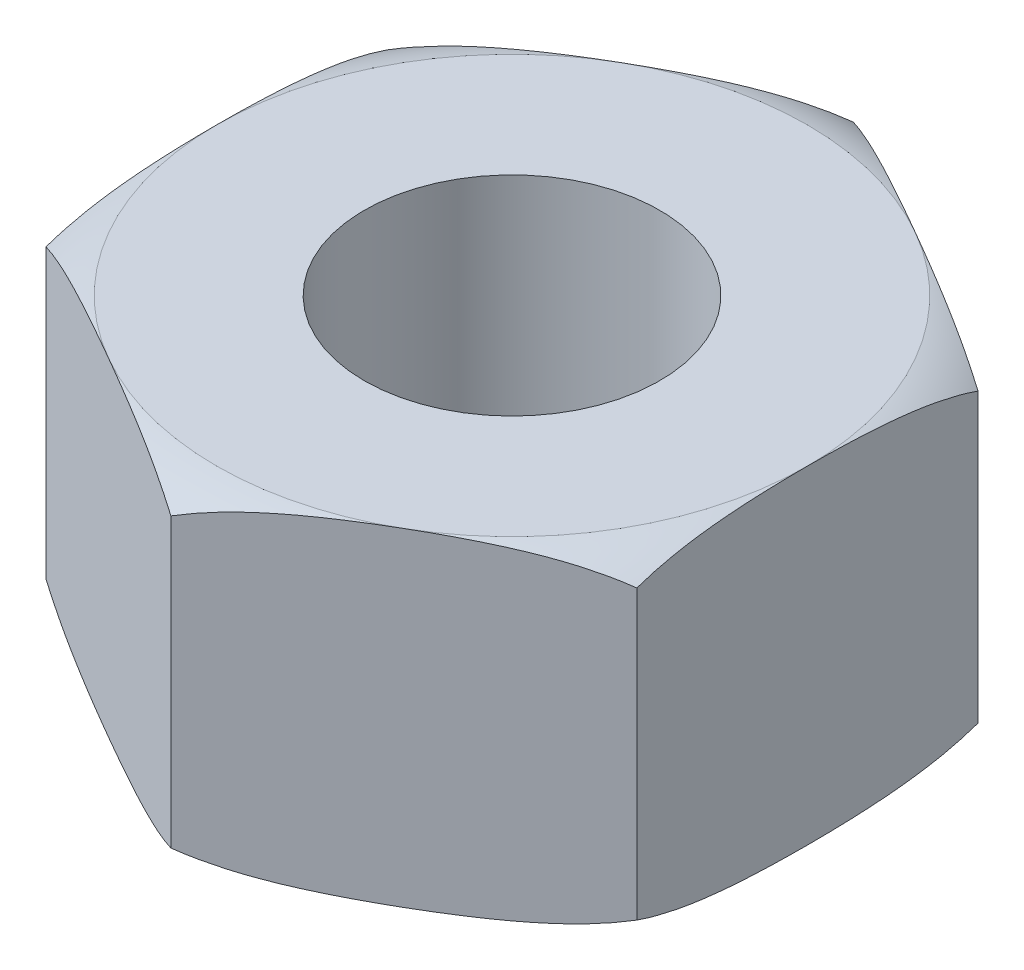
ISO-10303-21;
HEADER;
FILE_DESCRIPTION(('STEP AP214'),'2;1');
FILE_NAME('part.step','',(''),(''),'','','');
FILE_SCHEMA(('AUTOMOTIVE_DESIGN { 1 0 10303 214 1 1 1 1 }'));
ENDSEC;
DATA;
#1=APPLICATION_CONTEXT('core data for automotive mechanical design processes');
#2=APPLICATION_PROTOCOL_DEFINITION('international standard','automotive_design',2000,#1);
#3=PRODUCT_CONTEXT('',#1,'mechanical');
#4=PRODUCT('Part','Part','',(#3));
#5=PRODUCT_RELATED_PRODUCT_CATEGORY('part','',(#4));
#6=PRODUCT_DEFINITION_FORMATION('','',#4);
#7=PRODUCT_DEFINITION_CONTEXT('part definition',#1,'design');
#8=PRODUCT_DEFINITION('design','',#6,#7);
#9=PRODUCT_DEFINITION_SHAPE('','',#8);
#10=(LENGTH_UNIT() NAMED_UNIT(*) SI_UNIT(.MILLI.,.METRE.));
#11=(NAMED_UNIT(*) PLANE_ANGLE_UNIT() SI_UNIT($,.RADIAN.));
#12=(NAMED_UNIT(*) SI_UNIT($,.STERADIAN.) SOLID_ANGLE_UNIT());
#13=UNCERTAINTY_MEASURE_WITH_UNIT(LENGTH_MEASURE(1.E-05),#10,'distance_accuracy_value','');
#14=(GEOMETRIC_REPRESENTATION_CONTEXT(3) GLOBAL_UNCERTAINTY_ASSIGNED_CONTEXT((#13)) GLOBAL_UNIT_ASSIGNED_CONTEXT((#10,
#11,#12)) REPRESENTATION_CONTEXT('',''));
#15=CARTESIAN_POINT('',(0.,0.,0.));
#16=DIRECTION('',(0.,0.,1.));
#17=DIRECTION('',(1.,0.,0.));
#18=AXIS2_PLACEMENT_3D('',#15,#16,#17);
#19=CARTESIAN_POINT('',(0.,-5.,0.));
#20=DIRECTION('',(0.,1.,0.));
#21=DIRECTION('',(0.,0.,1.));
#22=AXIS2_PLACEMENT_3D('',#19,#20,#21);
#23=PLANE('',#22);
#24=CARTESIAN_POINT('',(0.,-5.,0.));
#25=DIRECTION('',(0.,1.,0.));
#26=DIRECTION('',(0.,0.,1.));
#27=AXIS2_PLACEMENT_3D('',#24,#25,#26);
#28=CIRCLE('',#27,4.5);
#29=CARTESIAN_POINT('',(0.,-5.,4.5));
#30=VERTEX_POINT('',#29);
#31=EDGE_CURVE('E270',#30,#30,#28,.T.);
#32=ORIENTED_EDGE('',*,*,#31,.T.);
#33=EDGE_LOOP('',(#32));
#34=FACE_BOUND('',#33,.T.);
#35=CARTESIAN_POINT('',(0.,-5.,0.));
#36=DIRECTION('',(0.,-1.,0.));
#37=DIRECTION('',(0.,0.,-1.));
#38=AXIS2_PLACEMENT_3D('',#35,#36,#37);
#39=CIRCLE('',#38,9.);
#40=CARTESIAN_POINT('',(4.5,-5.,7.79422863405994));
#41=VERTEX_POINT('',#40);
#42=CARTESIAN_POINT('',(-4.5,-5.,7.79422863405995));
#43=VERTEX_POINT('',#42);
#44=EDGE_CURVE('E142',#41,#43,#39,.T.);
#45=ORIENTED_EDGE('',*,*,#44,.T.);
#46=CARTESIAN_POINT('',(-9.,-5.,0.));
#47=VERTEX_POINT('',#46);
#48=EDGE_CURVE('E155',#43,#47,#39,.T.);
#49=ORIENTED_EDGE('',*,*,#48,.T.);
#50=CARTESIAN_POINT('',(-4.5,-5.,-7.79422863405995));
#51=VERTEX_POINT('',#50);
#52=EDGE_CURVE('E440',#47,#51,#39,.T.);
#53=ORIENTED_EDGE('',*,*,#52,.T.);
#54=CARTESIAN_POINT('',(4.5,-5.,-7.79422863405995));
#55=VERTEX_POINT('',#54);
#56=EDGE_CURVE('E177',#51,#55,#39,.T.);
#57=ORIENTED_EDGE('',*,*,#56,.T.);
#58=CARTESIAN_POINT('',(9.,-5.,0.));
#59=VERTEX_POINT('',#58);
#60=EDGE_CURVE('E71',#55,#59,#39,.T.);
#61=ORIENTED_EDGE('',*,*,#60,.T.);
#62=EDGE_CURVE('E154',#59,#41,#39,.T.);
#63=ORIENTED_EDGE('',*,*,#62,.T.);
#64=EDGE_LOOP('',(#45,#49,#53,#57,#61,#63));
#65=FACE_BOUND('',#64,.T.);
#66=ADVANCED_FACE('F49',(#34,#65),#23,.F.);
#67=CARTESIAN_POINT('',(0.,5.,0.));
#68=DIRECTION('',(0.,1.,0.));
#69=DIRECTION('',(0.,0.,1.));
#70=AXIS2_PLACEMENT_3D('',#67,#68,#69);
#71=PLANE('',#70);
#72=CARTESIAN_POINT('',(0.,5.,0.));
#73=DIRECTION('',(0.,1.,0.));
#74=DIRECTION('',(0.,0.,1.));
#75=AXIS2_PLACEMENT_3D('',#72,#73,#74);
#76=CIRCLE('',#75,4.5);
#77=CARTESIAN_POINT('',(0.,5.,4.5));
#78=VERTEX_POINT('',#77);
#79=EDGE_CURVE('E265',#78,#78,#76,.T.);
#80=ORIENTED_EDGE('',*,*,#79,.F.);
#81=EDGE_LOOP('',(#80));
#82=FACE_BOUND('',#81,.T.);
#83=CARTESIAN_POINT('',(0.,5.,0.));
#84=DIRECTION('',(0.,-1.,0.));
#85=DIRECTION('',(0.,0.,-1.));
#86=AXIS2_PLACEMENT_3D('',#83,#84,#85);
#87=CIRCLE('',#86,9.);
#88=CARTESIAN_POINT('',(-4.5,5.,7.79422863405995));
#89=VERTEX_POINT('',#88);
#90=CARTESIAN_POINT('',(-9.,5.,0.));
#91=VERTEX_POINT('',#90);
#92=EDGE_CURVE('E329',#89,#91,#87,.T.);
#93=ORIENTED_EDGE('',*,*,#92,.F.);
#94=CARTESIAN_POINT('',(4.5,5.,7.79422863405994));
#95=VERTEX_POINT('',#94);
#96=EDGE_CURVE('E331',#95,#89,#87,.T.);
#97=ORIENTED_EDGE('',*,*,#96,.F.);
#98=CARTESIAN_POINT('',(9.,5.,0.));
#99=VERTEX_POINT('',#98);
#100=EDGE_CURVE('E341',#99,#95,#87,.T.);
#101=ORIENTED_EDGE('',*,*,#100,.F.);
#102=CARTESIAN_POINT('',(4.5,5.,-7.79422863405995));
#103=VERTEX_POINT('',#102);
#104=EDGE_CURVE('E230',#103,#99,#87,.T.);
#105=ORIENTED_EDGE('',*,*,#104,.F.);
#106=CARTESIAN_POINT('',(-4.5,5.,-7.79422863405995));
#107=VERTEX_POINT('',#106);
#108=EDGE_CURVE('E342',#107,#103,#87,.T.);
#109=ORIENTED_EDGE('',*,*,#108,.F.);
#110=EDGE_CURVE('E333',#91,#107,#87,.T.);
#111=ORIENTED_EDGE('',*,*,#110,.F.);
#112=EDGE_LOOP('',(#93,#97,#101,#105,#109,#111));
#113=FACE_BOUND('',#112,.T.);
#114=ADVANCED_FACE('F309',(#82,#113),#71,.T.);
#115=CARTESIAN_POINT('',(8.99999999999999,5.,-5.19615242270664));
#116=DIRECTION('',(-0.5,0.,0.866025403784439));
#117=DIRECTION('',(0.866025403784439,0.,0.5));
#118=AXIS2_PLACEMENT_3D('',#115,#116,#117);
#119=PLANE('',#118);
#120=DIRECTION('',(0.,-1.,0.));
#121=VECTOR('',#120,1.);
#122=CARTESIAN_POINT('',(8.99999999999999,5.,-5.19615242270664));
#123=LINE('',#122,#121);
#124=CARTESIAN_POINT('',(8.99999999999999,4.38154906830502,-5.19615242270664));
#125=VERTEX_POINT('',#124);
#126=CARTESIAN_POINT('',(8.99999999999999,-4.38154906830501,-5.19615242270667));
#127=VERTEX_POINT('',#126);
#128=EDGE_CURVE('E269',#125,#127,#123,.T.);
#129=ORIENTED_EDGE('',*,*,#128,.T.);
#130=CARTESIAN_POINT('',(9.00019999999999,-4.38146842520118,-5.1960369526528));
#131=CARTESIAN_POINT('',(8.86047987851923,-4.43777502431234,-5.27670440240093));
#132=CARTESIAN_POINT('',(8.71914700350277,-4.48840627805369,-5.35830297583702));
#133=CARTESIAN_POINT('',(8.43425004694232,-4.57969822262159,-5.52278831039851));
#134=CARTESIAN_POINT('',(8.29068877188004,-4.62037051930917,-5.60567345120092));
#135=CARTESIAN_POINT('',(8.00285263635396,-4.6930341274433,-5.7718557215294));
#136=CARTESIAN_POINT('',(7.85858702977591,-4.72507539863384,-5.85514750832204));
#137=CARTESIAN_POINT('',(7.5689758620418,-4.78208549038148,-6.02235459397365));
#138=CARTESIAN_POINT('',(7.42362996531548,-4.80705201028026,-6.1062700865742));
#139=CARTESIAN_POINT('',(7.13395728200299,-4.8508151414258,-6.27351268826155));
#140=CARTESIAN_POINT('',(6.98963802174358,-4.86967946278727,-6.35683545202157));
#141=CARTESIAN_POINT('',(6.70058450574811,-4.9026270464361,-6.52372057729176));
#142=CARTESIAN_POINT('',(6.5558502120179,-4.91670985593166,-6.60728296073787));
#143=CARTESIAN_POINT('',(6.26581925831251,-4.94097813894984,-6.774732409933));
#144=CARTESIAN_POINT('',(6.12052206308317,-4.95115489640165,-6.85861978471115));
#145=CARTESIAN_POINT('',(5.82979337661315,-4.96826939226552,-7.02647207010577));
#146=CARTESIAN_POINT('',(5.68436188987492,-4.97520723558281,-7.11043697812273));
#147=CARTESIAN_POINT('',(5.30823641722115,-4.98967947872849,-7.32759312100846));
#148=CARTESIAN_POINT('',(5.07748414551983,-4.99518413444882,-7.46081800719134));
#149=CARTESIAN_POINT('',(4.61594428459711,-5.00069403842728,-7.72728817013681));
#150=CARTESIAN_POINT('',(4.3851566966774,-5.0006994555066,-7.86053344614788));
#151=CARTESIAN_POINT('',(3.92417062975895,-4.99521156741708,-8.12668387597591));
#152=CARTESIAN_POINT('',(3.69397204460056,-4.9897312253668,-8.25958909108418));
#153=CARTESIAN_POINT('',(3.23368843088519,-4.97208679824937,-8.52533395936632));
#154=CARTESIAN_POINT('',(3.00360345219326,-4.95992084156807,-8.65817358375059));
#155=CARTESIAN_POINT('',(2.5395744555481,-4.92625738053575,-8.92608084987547));
#156=CARTESIAN_POINT('',(2.30563933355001,-4.90458851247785,-9.06114335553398));
#157=CARTESIAN_POINT('',(1.83905964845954,-4.8483685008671,-9.33052326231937));
#158=CARTESIAN_POINT('',(1.60641412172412,-4.81382884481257,-9.46484121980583));
#159=CARTESIAN_POINT('',(1.25854679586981,-4.7488545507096,-9.66568251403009));
#160=CARTESIAN_POINT('',(1.14241504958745,-4.72490710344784,-9.73273120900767));
#161=CARTESIAN_POINT('',(0.911033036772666,-4.67195657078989,-9.86631967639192));
#162=CARTESIAN_POINT('',(0.795782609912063,-4.64295442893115,-9.93285954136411));
#163=CARTESIAN_POINT('',(0.566111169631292,-4.57910445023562,-10.0654604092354));
#164=CARTESIAN_POINT('',(0.45169381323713,-4.54423885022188,-10.1315193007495));
#165=CARTESIAN_POINT('',(0.224431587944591,-4.46795482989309,-10.2627292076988));
#166=CARTESIAN_POINT('',(0.111587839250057,-4.42653197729,-10.327879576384));
#167=CARTESIAN_POINT('',(-0.000199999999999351,-4.38146842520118,-10.3924203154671));
#168=B_SPLINE_CURVE_WITH_KNOTS('',3,(#130,#131,#132,#133,#134,#135,#136,#137,#138,#139,#140,
#141,#142,#143,#144,#145,#146,#147,#148,#149,#150,#151,#152,#153,#154,#155,#156,#157,#158,#159,
#160,#161,#162,#163,#164,#165,#166,#167),.UNSPECIFIED.,.F.,.F.,(4,2,2,2,2,2,2,2,2,2,2,2,2,2,2,2,
2,2,4),(0.,0.512369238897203,1.02413850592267,1.53287849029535,2.04178372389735,
2.54483127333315,3.04792644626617,3.55213780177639,4.05633282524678,4.8557785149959,
5.65519966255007,6.45273618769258,7.25049609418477,8.06327461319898,8.87532943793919,
9.28390643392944,9.692407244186,10.1021686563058,10.5122082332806),.UNSPECIFIED.);
#169=EDGE_CURVE('E212',#127,#55,#168,.T.);
#170=ORIENTED_EDGE('',*,*,#169,.T.);
#171=CARTESIAN_POINT('',(-2.49098020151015E-11,-4.38154906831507,-10.3923048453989));
#172=VERTEX_POINT('',#171);
#173=EDGE_CURVE('E220',#55,#172,#168,.T.);
#174=ORIENTED_EDGE('',*,*,#173,.T.);
#175=DIRECTION('',(0.,-1.,0.));
#176=VECTOR('',#175,1.);
#177=CARTESIAN_POINT('',(0.,5.,-10.3923048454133));
#178=LINE('',#177,#176);
#179=CARTESIAN_POINT('',(2.48502978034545E-11,4.38154906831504,-10.3923048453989));
#180=VERTEX_POINT('',#179);
#181=EDGE_CURVE('E290',#180,#172,#178,.T.);
#182=ORIENTED_EDGE('',*,*,#181,.F.);
#183=CARTESIAN_POINT('',(-0.000200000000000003,4.38146842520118,-10.3924203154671));
#184=CARTESIAN_POINT('',(0.139520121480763,4.43777502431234,-10.311752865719));
#185=CARTESIAN_POINT('',(0.280852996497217,4.48840627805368,-10.2301542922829));
#186=CARTESIAN_POINT('',(0.565749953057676,4.57969822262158,-10.0656689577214));
#187=CARTESIAN_POINT('',(0.709311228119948,4.62037051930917,-9.98278381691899));
#188=CARTESIAN_POINT('',(0.997147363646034,4.6930341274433,-9.8166015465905));
#189=CARTESIAN_POINT('',(1.14141297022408,4.72507539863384,-9.73330975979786));
#190=CARTESIAN_POINT('',(1.43102413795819,4.78208549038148,-9.56610267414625));
#191=CARTESIAN_POINT('',(1.57637003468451,4.80705201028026,-9.4821871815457));
#192=CARTESIAN_POINT('',(1.86604271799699,4.8508151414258,-9.31494457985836));
#193=CARTESIAN_POINT('',(2.01036197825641,4.86967946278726,-9.23162181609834));
#194=CARTESIAN_POINT('',(2.29941549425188,4.9026270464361,-9.06473669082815));
#195=CARTESIAN_POINT('',(2.44414978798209,4.91670985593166,-8.98117430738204));
#196=CARTESIAN_POINT('',(2.73418074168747,4.94097813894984,-8.81372485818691));
#197=CARTESIAN_POINT('',(2.87947793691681,4.95115489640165,-8.72983748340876));
#198=CARTESIAN_POINT('',(3.17020662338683,4.96826939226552,-8.56198519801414));
#199=CARTESIAN_POINT('',(3.31563811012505,4.97520723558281,-8.47802028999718));
#200=CARTESIAN_POINT('',(3.69176358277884,4.98967947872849,-8.26086414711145));
#201=CARTESIAN_POINT('',(3.92251585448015,4.99518413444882,-8.12763926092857));
#202=CARTESIAN_POINT('',(4.38405571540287,5.00069403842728,-7.8611690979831));
#203=CARTESIAN_POINT('',(4.61484330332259,5.0006994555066,-7.72792382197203));
#204=CARTESIAN_POINT('',(5.07582937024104,4.99521156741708,-7.46177339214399));
#205=CARTESIAN_POINT('',(5.30602795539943,4.9897312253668,-7.32886817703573));
#206=CARTESIAN_POINT('',(5.7663115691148,4.97208679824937,-7.06312330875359));
#207=CARTESIAN_POINT('',(5.99639654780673,4.95992084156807,-6.93028368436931));
#208=CARTESIAN_POINT('',(6.46042554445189,4.92625738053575,-6.66237641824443));
#209=CARTESIAN_POINT('',(6.69436066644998,4.90458851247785,-6.52731391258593));
#210=CARTESIAN_POINT('',(7.16094035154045,4.8483685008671,-6.25793400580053));
#211=CARTESIAN_POINT('',(7.39358587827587,4.81382884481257,-6.12361604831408));
#212=CARTESIAN_POINT('',(7.74145320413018,4.7488545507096,-5.92277475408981));
#213=CARTESIAN_POINT('',(7.85758495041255,4.72490710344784,-5.85572605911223));
#214=CARTESIAN_POINT('',(8.08896696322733,4.67195657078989,-5.72213759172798));
#215=CARTESIAN_POINT('',(8.20421739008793,4.64295442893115,-5.65559772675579));
#216=CARTESIAN_POINT('',(8.4338888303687,4.57910445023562,-5.52299685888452));
#217=CARTESIAN_POINT('',(8.54830618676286,4.54423885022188,-5.45693796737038));
#218=CARTESIAN_POINT('',(8.7755684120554,4.46795482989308,-5.3257280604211));
#219=CARTESIAN_POINT('',(8.88841216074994,4.42653197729,-5.26057769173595));
#220=CARTESIAN_POINT('',(9.00019999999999,4.38146842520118,-5.1960369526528));
#221=B_SPLINE_CURVE_WITH_KNOTS('',3,(#183,#184,#185,#186,#187,#188,#189,#190,#191,#192,#193,
#194,#195,#196,#197,#198,#199,#200,#201,#202,#203,#204,#205,#206,#207,#208,#209,#210,#211,#212,
#213,#214,#215,#216,#217,#218,#219,#220),.UNSPECIFIED.,.F.,.F.,(4,2,2,2,2,2,2,2,2,2,2,2,2,2,2,2,
2,2,4),(0.,0.5123692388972,1.02413850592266,1.53287849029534,2.04178372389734,2.54483127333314,
3.04792644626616,3.55213780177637,4.05633282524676,4.85577851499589,5.65519966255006,
6.45273618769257,7.25049609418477,8.06327461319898,8.87532943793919,9.28390643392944,
9.692407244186,10.1021686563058,10.5122082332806),.UNSPECIFIED.);
#222=EDGE_CURVE('E374',#180,#103,#221,.T.);
#223=ORIENTED_EDGE('',*,*,#222,.T.);
#224=EDGE_CURVE('E359',#103,#125,#221,.T.);
#225=ORIENTED_EDGE('',*,*,#224,.T.);
#226=EDGE_LOOP('',(#129,#170,#174,#182,#223,#225));
#227=FACE_BOUND('',#226,.T.);
#228=ADVANCED_FACE('F51',(#227),#119,.F.);
#229=CARTESIAN_POINT('',(0.,5.,-10.3923048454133));
#230=DIRECTION('',(0.5,0.,0.866025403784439));
#231=DIRECTION('',(0.866025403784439,0.,-0.5));
#232=AXIS2_PLACEMENT_3D('',#229,#230,#231);
#233=PLANE('',#232);
#234=ORIENTED_EDGE('',*,*,#181,.T.);
#235=CARTESIAN_POINT('',(0.000199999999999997,-4.38146842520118,-10.3924203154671));
#236=CARTESIAN_POINT('',(-0.139520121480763,-4.43777502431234,-10.311752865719));
#237=CARTESIAN_POINT('',(-0.280852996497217,-4.48840627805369,-10.2301542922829));
#238=CARTESIAN_POINT('',(-0.565749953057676,-4.57969822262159,-10.0656689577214));
#239=CARTESIAN_POINT('',(-0.709311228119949,-4.62037051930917,-9.98278381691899));
#240=CARTESIAN_POINT('',(-0.997147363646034,-4.6930341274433,-9.8166015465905));
#241=CARTESIAN_POINT('',(-1.14141297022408,-4.72507539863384,-9.73330975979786));
#242=CARTESIAN_POINT('',(-1.43102413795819,-4.78208549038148,-9.56610267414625));
#243=CARTESIAN_POINT('',(-1.57637003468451,-4.80705201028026,-9.4821871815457));
#244=CARTESIAN_POINT('',(-1.86604271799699,-4.8508151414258,-9.31494457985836));
#245=CARTESIAN_POINT('',(-2.01036197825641,-4.86967946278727,-9.23162181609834));
#246=CARTESIAN_POINT('',(-2.29941549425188,-4.9026270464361,-9.06473669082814));
#247=CARTESIAN_POINT('',(-2.44414978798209,-4.91670985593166,-8.98117430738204));
#248=CARTESIAN_POINT('',(-2.73418074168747,-4.94097813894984,-8.81372485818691));
#249=CARTESIAN_POINT('',(-2.87947793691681,-4.95115489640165,-8.72983748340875));
#250=CARTESIAN_POINT('',(-3.17020662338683,-4.96826939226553,-8.56198519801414));
#251=CARTESIAN_POINT('',(-3.31563811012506,-4.97520723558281,-8.47802028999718));
#252=CARTESIAN_POINT('',(-3.69176358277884,-4.98967947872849,-8.26086414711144));
#253=CARTESIAN_POINT('',(-3.92251585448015,-4.99518413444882,-8.12763926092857));
#254=CARTESIAN_POINT('',(-4.38405571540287,-5.00069403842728,-7.8611690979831));
#255=CARTESIAN_POINT('',(-4.61484330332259,-5.0006994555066,-7.72792382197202));
#256=CARTESIAN_POINT('',(-5.07582937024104,-4.99521156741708,-7.46177339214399));
#257=CARTESIAN_POINT('',(-5.30602795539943,-4.9897312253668,-7.32886817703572));
#258=CARTESIAN_POINT('',(-5.7663115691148,-4.97208679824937,-7.06312330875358));
#259=CARTESIAN_POINT('',(-5.99639654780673,-4.95992084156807,-6.9302836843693));
#260=CARTESIAN_POINT('',(-6.46042554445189,-4.92625738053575,-6.66237641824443));
#261=CARTESIAN_POINT('',(-6.69436066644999,-4.90458851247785,-6.52731391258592));
#262=CARTESIAN_POINT('',(-7.16094035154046,-4.8483685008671,-6.25793400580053));
#263=CARTESIAN_POINT('',(-7.39358587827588,-4.81382884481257,-6.12361604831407));
#264=CARTESIAN_POINT('',(-7.74145320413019,-4.7488545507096,-5.92277475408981));
#265=CARTESIAN_POINT('',(-7.85758495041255,-4.72490710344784,-5.85572605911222));
#266=CARTESIAN_POINT('',(-8.08896696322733,-4.67195657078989,-5.72213759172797));
#267=CARTESIAN_POINT('',(-8.20421739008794,-4.64295442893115,-5.65559772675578));
#268=CARTESIAN_POINT('',(-8.43388883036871,-4.57910445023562,-5.52299685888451));
#269=CARTESIAN_POINT('',(-8.54830618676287,-4.54423885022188,-5.45693796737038));
#270=CARTESIAN_POINT('',(-8.77556841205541,-4.46795482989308,-5.32572806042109));
#271=CARTESIAN_POINT('',(-8.88841216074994,-4.42653197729,-5.26057769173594));
#272=CARTESIAN_POINT('',(-9.0002,-4.38146842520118,-5.19603695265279));
#273=B_SPLINE_CURVE_WITH_KNOTS('',3,(#235,#236,#237,#238,#239,#240,#241,#242,#243,#244,#245,
#246,#247,#248,#249,#250,#251,#252,#253,#254,#255,#256,#257,#258,#259,#260,#261,#262,#263,#264,
#265,#266,#267,#268,#269,#270,#271,#272),.UNSPECIFIED.,.F.,.F.,(4,2,2,2,2,2,2,2,2,2,2,2,2,2,2,2,
2,2,4),(0.,0.5123692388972,1.02413850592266,1.53287849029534,2.04178372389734,2.54483127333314,
3.04792644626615,3.55213780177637,4.05633282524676,4.85577851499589,5.65519966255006,
6.45273618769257,7.25049609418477,8.06327461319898,8.87532943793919,9.28390643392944,
9.69240724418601,10.1021686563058,10.5122082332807),.UNSPECIFIED.);
#274=EDGE_CURVE('E229',#172,#51,#273,.T.);
#275=ORIENTED_EDGE('',*,*,#274,.T.);
#276=CARTESIAN_POINT('',(-9.,-4.38154906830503,-5.19615242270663));
#277=VERTEX_POINT('',#276);
#278=EDGE_CURVE('E221',#51,#277,#273,.T.);
#279=ORIENTED_EDGE('',*,*,#278,.T.);
#280=DIRECTION('',(0.,-1.,0.));
#281=VECTOR('',#280,1.);
#282=CARTESIAN_POINT('',(-9.,5.,-5.19615242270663));
#283=LINE('',#282,#281);
#284=CARTESIAN_POINT('',(-8.99999999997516,4.38154906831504,-5.19615242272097));
#285=VERTEX_POINT('',#284);
#286=EDGE_CURVE('E286',#285,#277,#283,.T.);
#287=ORIENTED_EDGE('',*,*,#286,.F.);
#288=CARTESIAN_POINT('',(-9.0002,4.38146842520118,-5.19603695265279));
#289=CARTESIAN_POINT('',(-8.86047987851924,4.43777502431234,-5.27670440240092));
#290=CARTESIAN_POINT('',(-8.71914700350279,4.48840627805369,-5.35830297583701));
#291=CARTESIAN_POINT('',(-8.43425004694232,4.57969822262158,-5.5227883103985));
#292=CARTESIAN_POINT('',(-8.29068877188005,4.62037051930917,-5.60567345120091));
#293=CARTESIAN_POINT('',(-8.00285263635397,4.6930341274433,-5.77185572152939));
#294=CARTESIAN_POINT('',(-7.85858702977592,4.72507539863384,-5.85514750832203));
#295=CARTESIAN_POINT('',(-7.56897586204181,4.78208549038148,-6.02235459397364));
#296=CARTESIAN_POINT('',(-7.42362996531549,4.80705201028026,-6.10627008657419));
#297=CARTESIAN_POINT('',(-7.13395728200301,4.8508151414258,-6.27351268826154));
#298=CARTESIAN_POINT('',(-6.98963802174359,4.86967946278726,-6.35683545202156));
#299=CARTESIAN_POINT('',(-6.70058450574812,4.9026270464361,-6.52372057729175));
#300=CARTESIAN_POINT('',(-6.55585021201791,4.91670985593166,-6.60728296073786));
#301=CARTESIAN_POINT('',(-6.26581925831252,4.94097813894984,-6.77473240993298));
#302=CARTESIAN_POINT('',(-6.12052206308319,4.95115489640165,-6.85861978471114));
#303=CARTESIAN_POINT('',(-5.82979337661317,4.96826939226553,-7.02647207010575));
#304=CARTESIAN_POINT('',(-5.68436188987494,4.97520723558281,-7.11043697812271));
#305=CARTESIAN_POINT('',(-5.30823641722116,4.98967947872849,-7.32759312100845));
#306=CARTESIAN_POINT('',(-5.07748414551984,4.99518413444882,-7.46081800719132));
#307=CARTESIAN_POINT('',(-4.61594428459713,5.00069403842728,-7.7272881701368));
#308=CARTESIAN_POINT('',(-4.38515669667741,5.0006994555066,-7.86053344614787));
#309=CARTESIAN_POINT('',(-3.92417062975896,4.99521156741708,-8.1266838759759));
#310=CARTESIAN_POINT('',(-3.69397204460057,4.9897312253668,-8.25958909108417));
#311=CARTESIAN_POINT('',(-3.2336884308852,4.97208679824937,-8.52533395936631));
#312=CARTESIAN_POINT('',(-3.00360345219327,4.95992084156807,-8.65817358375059));
#313=CARTESIAN_POINT('',(-2.53957445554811,4.92625738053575,-8.92608084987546));
#314=CARTESIAN_POINT('',(-2.30563933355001,4.90458851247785,-9.06114335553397));
#315=CARTESIAN_POINT('',(-1.83905964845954,4.8483685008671,-9.33052326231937));
#316=CARTESIAN_POINT('',(-1.60641412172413,4.81382884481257,-9.46484121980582));
#317=CARTESIAN_POINT('',(-1.25854679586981,4.7488545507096,-9.66568251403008));
#318=CARTESIAN_POINT('',(-1.14241504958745,4.72490710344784,-9.73273120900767));
#319=CARTESIAN_POINT('',(-0.911033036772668,4.67195657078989,-9.86631967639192));
#320=CARTESIAN_POINT('',(-0.795782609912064,4.64295442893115,-9.93285954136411));
#321=CARTESIAN_POINT('',(-0.566111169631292,4.57910445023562,-10.0654604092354));
#322=CARTESIAN_POINT('',(-0.45169381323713,4.54423885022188,-10.1315193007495));
#323=CARTESIAN_POINT('',(-0.22443158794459,4.46795482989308,-10.2627292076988));
#324=CARTESIAN_POINT('',(-0.111587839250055,4.42653197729,-10.327879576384));
#325=CARTESIAN_POINT('',(0.000200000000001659,4.38146842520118,-10.3924203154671));
#326=B_SPLINE_CURVE_WITH_KNOTS('',3,(#288,#289,#290,#291,#292,#293,#294,#295,#296,#297,#298,
#299,#300,#301,#302,#303,#304,#305,#306,#307,#308,#309,#310,#311,#312,#313,#314,#315,#316,#317,
#318,#319,#320,#321,#322,#323,#324,#325),.UNSPECIFIED.,.F.,.F.,(4,2,2,2,2,2,2,2,2,2,2,2,2,2,2,2,
2,2,4),(0.,0.512369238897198,1.02413850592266,1.53287849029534,2.04178372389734,
2.54483127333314,3.04792644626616,3.55213780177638,4.05633282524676,4.85577851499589,
5.65519966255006,6.45273618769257,7.25049609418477,8.06327461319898,8.87532943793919,
9.28390643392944,9.69240724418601,10.1021686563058,10.5122082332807),.UNSPECIFIED.);
#327=EDGE_CURVE('E249',#285,#107,#326,.T.);
#328=ORIENTED_EDGE('',*,*,#327,.T.);
#329=EDGE_CURVE('E240',#107,#180,#326,.T.);
#330=ORIENTED_EDGE('',*,*,#329,.T.);
#331=EDGE_LOOP('',(#234,#275,#279,#287,#328,#330));
#332=FACE_BOUND('',#331,.T.);
#333=ADVANCED_FACE('F232',(#332),#233,.F.);
#334=CARTESIAN_POINT('',(-9.,5.,-5.19615242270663));
#335=DIRECTION('',(1.,0.,0.));
#336=DIRECTION('',(0.,0.,-1.));
#337=AXIS2_PLACEMENT_3D('',#334,#335,#336);
#338=PLANE('',#337);
#339=CARTESIAN_POINT('',(-9.,-5.,0.));
#340=CARTESIAN_POINT('',(-9.,-5.00000007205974,0.150265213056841));
#341=CARTESIAN_POINT('',(-9.,-4.99913966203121,0.300530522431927));
#342=CARTESIAN_POINT('',(-9.,-4.99562802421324,0.601040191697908));
#343=CARTESIAN_POINT('',(-9.,-4.99297677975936,0.751284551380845));
#344=CARTESIAN_POINT('',(-9.,-4.98209597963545,1.20201655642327));
#345=CARTESIAN_POINT('',(-9.,-4.97093925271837,1.50244598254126));
#346=CARTESIAN_POINT('',(-9.,-4.93796657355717,2.10302057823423));
#347=CARTESIAN_POINT('',(-9.,-4.91614106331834,2.40316525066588));
#348=CARTESIAN_POINT('',(-9.,-4.85721935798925,3.00194392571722));
#349=CARTESIAN_POINT('',(-9.,-4.8201301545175,3.30057855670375));
#350=CARTESIAN_POINT('',(-9.,-4.74310313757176,3.7794479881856));
#351=CARTESIAN_POINT('',(-9.,-4.70983168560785,3.96074465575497));
#352=CARTESIAN_POINT('',(-9.,-4.63363661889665,4.32127986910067));
#353=CARTESIAN_POINT('',(-9.,-4.59071574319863,4.50051898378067));
#354=CARTESIAN_POINT('',(-9.,-4.49352421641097,4.85565737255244));
#355=CARTESIAN_POINT('',(-9.,-4.4392706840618,5.0315612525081));
#356=CARTESIAN_POINT('',(-9.,-4.31754984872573,5.37868413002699));
#357=CARTESIAN_POINT('',(-9.,-4.25008841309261,5.54990516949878));
#358=CARTESIAN_POINT('',(-9.,-4.07365021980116,5.94477353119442));
#359=CARTESIAN_POINT('',(-9.,-3.95841479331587,6.16570598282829));
#360=CARTESIAN_POINT('',(-9.,-3.69605602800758,6.58798233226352));
#361=CARTESIAN_POINT('',(-9.,-3.54896891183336,6.78934810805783));
#362=CARTESIAN_POINT('',(-9.,-3.25877385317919,7.11854073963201));
#363=CARTESIAN_POINT('',(-9.,-3.1227407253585,7.25256494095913));
#364=CARTESIAN_POINT('',(-9.,-2.83076094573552,7.49692051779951));
#365=CARTESIAN_POINT('',(-9.,-2.67483829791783,7.60728002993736));
#366=CARTESIAN_POINT('',(-9.,-2.37099232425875,7.78303280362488));
#367=CARTESIAN_POINT('',(-8.99999999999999,-2.22557664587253,7.8527448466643));
#368=CARTESIAN_POINT('',(-8.99999999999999,-1.92508744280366,7.96690960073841));
#369=CARTESIAN_POINT('',(-8.99999999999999,-1.77001804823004,8.01137303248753));
#370=CARTESIAN_POINT('',(-8.99999999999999,-1.45382476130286,8.07238916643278));
#371=CARTESIAN_POINT('',(-8.99999999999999,-1.29268054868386,8.08883775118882));
#372=CARTESIAN_POINT('',(-8.99999999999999,-0.970067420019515,8.092367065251));
#373=CARTESIAN_POINT('',(-8.99999999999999,-0.808598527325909,8.07944983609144));
#374=CARTESIAN_POINT('',(-8.99999999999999,-0.500705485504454,8.02689004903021));
#375=CARTESIAN_POINT('',(-8.99999999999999,-0.353976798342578,7.9889951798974));
#376=CARTESIAN_POINT('',(-8.99999999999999,-0.0684796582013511,7.89040929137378));
#377=CARTESIAN_POINT('',(-9.,0.0702892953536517,7.82971970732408));
#378=CARTESIAN_POINT('',(-9.,0.344855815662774,7.68448793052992));
#379=CARTESIAN_POINT('',(-9.,0.480034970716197,7.5987849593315));
#380=CARTESIAN_POINT('',(-9.,0.736885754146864,7.40906636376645));
#381=CARTESIAN_POINT('',(-9.,0.858542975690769,7.30503150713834));
#382=CARTESIAN_POINT('',(-9.,1.14777284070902,7.02389386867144));
#383=CARTESIAN_POINT('',(-9.,1.30593654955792,6.837097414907));
#384=CARTESIAN_POINT('',(-9.,1.59015036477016,6.44099508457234));
#385=CARTESIAN_POINT('',(-9.,1.71618459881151,6.23167815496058));
#386=CARTESIAN_POINT('',(-9.,1.91667475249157,5.84342303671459));
#387=CARTESIAN_POINT('',(-9.,1.99640718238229,5.66714068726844));
#388=CARTESIAN_POINT('',(-9.,2.14016801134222,5.30820432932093));
#389=CARTESIAN_POINT('',(-9.,2.20418503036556,5.12554581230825));
#390=CARTESIAN_POINT('',(-9.,2.31903211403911,4.75477279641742));
#391=CARTESIAN_POINT('',(-9.,2.36976569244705,4.56662884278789));
#392=CARTESIAN_POINT('',(-9.,2.43711976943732,4.28245947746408));
#393=CARTESIAN_POINT('',(-9.,2.45810905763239,4.18743594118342));
#394=CARTESIAN_POINT('',(-9.,2.49743439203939,3.99684319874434));
#395=CARTESIAN_POINT('',(-9.,2.515770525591,3.90127401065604));
#396=CARTESIAN_POINT('',(-9.,2.56265178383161,3.63916470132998));
#397=CARTESIAN_POINT('',(-9.,2.58877082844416,3.47218969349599));
#398=CARTESIAN_POINT('',(-9.,2.63492994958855,3.13739066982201));
#399=CARTESIAN_POINT('',(-9.,2.65496892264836,2.96956650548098));
#400=CARTESIAN_POINT('',(-9.,2.69002344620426,2.63328226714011));
#401=CARTESIAN_POINT('',(-9.,2.70503541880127,2.46482182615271));
#402=CARTESIAN_POINT('',(-9.,2.73092407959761,2.12758177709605));
#403=CARTESIAN_POINT('',(-9.,2.74180054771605,1.95880215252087));
#404=CARTESIAN_POINT('',(-9.,2.76020981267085,1.62027729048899));
#405=CARTESIAN_POINT('',(-9.,2.76772681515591,1.4505312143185));
#406=CARTESIAN_POINT('',(-9.,2.77992982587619,1.11093813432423));
#407=CARTESIAN_POINT('',(-9.,2.78461580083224,0.941091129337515));
#408=CARTESIAN_POINT('',(-9.,2.79155547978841,0.601424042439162));
#409=CARTESIAN_POINT('',(-9.,2.79381025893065,0.431603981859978));
#410=CARTESIAN_POINT('',(-9.,2.79609526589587,0.0919503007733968));
#411=CARTESIAN_POINT('',(-9.,2.79612550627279,-0.0778833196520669));
#412=CARTESIAN_POINT('',(-9.,2.79396914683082,-0.416753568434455));
#413=CARTESIAN_POINT('',(-9.,2.79179277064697,-0.585790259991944));
#414=CARTESIAN_POINT('',(-9.,2.78504320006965,-0.923818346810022));
#415=CARTESIAN_POINT('',(-9.,2.78046998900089,-1.09280974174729));
#416=CARTESIAN_POINT('',(-9.,2.76853568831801,-1.43078928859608));
#417=CARTESIAN_POINT('',(-9.,2.76117307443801,-1.59977738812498));
#418=CARTESIAN_POINT('',(-9.,2.74308841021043,-1.9375757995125));
#419=CARTESIAN_POINT('',(-9.,2.73236640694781,-2.10638611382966));
#420=CARTESIAN_POINT('',(-9.,2.70688732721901,-2.44280813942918));
#421=CARTESIAN_POINT('',(-9.,2.69215195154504,-2.61042145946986));
#422=CARTESIAN_POINT('',(-9.,2.65773357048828,-2.94516309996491));
#423=CARTESIAN_POINT('',(-9.,2.63805016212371,-3.11229137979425));
#424=CARTESIAN_POINT('',(-9.,2.59273251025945,-3.44556560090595));
#425=CARTESIAN_POINT('',(-9.,2.56710480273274,-3.61171241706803));
#426=CARTESIAN_POINT('',(-9.,2.50873750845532,-3.94274734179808));
#427=CARTESIAN_POINT('',(-9.,2.4759990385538,-4.1076356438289));
#428=CARTESIAN_POINT('',(-9.,2.40816344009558,-4.40880573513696));
#429=CARTESIAN_POINT('',(-9.,2.37432120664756,-4.54536830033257));
#430=CARTESIAN_POINT('',(-9.,2.29995591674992,-4.81674530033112));
#431=CARTESIAN_POINT('',(-9.,2.25942964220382,-4.95155885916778));
#432=CARTESIAN_POINT('',(-9.,2.17092112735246,-5.2185772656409));
#433=CARTESIAN_POINT('',(-9.,2.12294781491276,-5.35078502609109));
#434=CARTESIAN_POINT('',(-9.,2.0187188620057,-5.61182811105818));
#435=CARTESIAN_POINT('',(-9.,1.962464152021,-5.7406638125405));
#436=CARTESIAN_POINT('',(-9.,1.77810868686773,-6.12446051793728));
#437=CARTESIAN_POINT('',(-9.,1.63557949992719,-6.37298946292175));
#438=CARTESIAN_POINT('',(-9.,1.38942253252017,-6.72261914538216));
#439=CARTESIAN_POINT('',(-9.,1.30200362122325,-6.83527513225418));
#440=CARTESIAN_POINT('',(-9.,1.11595460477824,-7.05087495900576));
#441=CARTESIAN_POINT('',(-9.,1.01733263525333,-7.15382574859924));
#442=CARTESIAN_POINT('',(-9.,0.784461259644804,-7.37029752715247));
#443=CARTESIAN_POINT('',(-9.,0.647264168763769,-7.48069437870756));
#444=CARTESIAN_POINT('',(-9.,0.356809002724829,-7.67804447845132));
#445=CARTESIAN_POINT('',(-9.,0.203565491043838,-7.76501873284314));
#446=CARTESIAN_POINT('',(-9.,-0.0365657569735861,-7.87438625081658));
#447=CARTESIAN_POINT('',(-9.,-0.118712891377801,-7.90742659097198));
#448=CARTESIAN_POINT('',(-9.,-0.285710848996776,-7.96571683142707));
#449=CARTESIAN_POINT('',(-9.,-0.370560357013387,-7.99097045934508));
#450=CARTESIAN_POINT('',(-9.,-0.542289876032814,-8.03321173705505));
#451=CARTESIAN_POINT('',(-9.,-0.629169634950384,-8.05020040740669));
#452=CARTESIAN_POINT('',(-9.,-0.804145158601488,-8.07559115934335));
#453=CARTESIAN_POINT('',(-9.,-0.892240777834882,-8.08399425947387));
#454=CARTESIAN_POINT('',(-9.,-1.13689748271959,-8.09509256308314));
#455=CARTESIAN_POINT('',(-9.,-1.29398763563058,-8.08842230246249));
#456=CARTESIAN_POINT('',(-9.,-1.60447512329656,-8.04791836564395));
#457=CARTESIAN_POINT('',(-9.,-1.75787324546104,-8.01409053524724));
#458=CARTESIAN_POINT('',(-9.,-2.05259797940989,-7.92270933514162));
#459=CARTESIAN_POINT('',(-9.,-2.19414340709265,-7.86585484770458));
#460=CARTESIAN_POINT('',(-9.,-2.46696466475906,-7.73142953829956));
#461=CARTESIAN_POINT('',(-9.,-2.59823599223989,-7.65384969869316));
#462=CARTESIAN_POINT('',(-9.,-2.8938540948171,-7.45014935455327));
#463=CARTESIAN_POINT('',(-9.,-3.05309670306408,-7.31660838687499));
#464=CARTESIAN_POINT('',(-9.,-3.34765254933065,-7.02544741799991));
#465=CARTESIAN_POINT('',(-9.,-3.48292630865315,-6.86778847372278));
#466=CARTESIAN_POINT('',(-9.,-3.78341958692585,-6.46373374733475));
#467=CARTESIAN_POINT('',(-9.,-3.93651371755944,-6.20832681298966));
#468=CARTESIAN_POINT('',(-9.,-4.13493088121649,-5.81026402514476));
#469=CARTESIAN_POINT('',(-9.,-4.19592908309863,-5.67488514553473));
#470=CARTESIAN_POINT('',(-9.,-4.30853427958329,-5.40026775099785));
#471=CARTESIAN_POINT('',(-9.,-4.36014342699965,-5.2610301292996));
#472=CARTESIAN_POINT('',(-9.,-4.46304033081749,-4.95569670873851));
#473=CARTESIAN_POINT('',(-9.,-4.51276343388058,-4.78908029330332));
#474=CARTESIAN_POINT('',(-9.,-4.60222351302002,-4.45321421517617));
#475=CARTESIAN_POINT('',(-9.,-4.64196000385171,-4.28396442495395));
#476=CARTESIAN_POINT('',(-9.,-4.71298194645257,-3.94340642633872));
#477=CARTESIAN_POINT('',(-9.,-4.7442519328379,-3.77209504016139));
#478=CARTESIAN_POINT('',(-9.,-4.79961230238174,-3.42834421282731));
#479=CARTESIAN_POINT('',(-9.,-4.82370304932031,-3.25590482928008));
#480=CARTESIAN_POINT('',(-9.,-4.86600738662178,-2.90973876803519));
#481=CARTESIAN_POINT('',(-9.,-4.88420118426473,-2.73600971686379));
#482=CARTESIAN_POINT('',(-9.,-4.91569016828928,-2.38810820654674));
#483=CARTESIAN_POINT('',(-9.,-4.92898508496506,-2.2139357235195));
#484=CARTESIAN_POINT('',(-9.,-4.95158194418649,-1.86548067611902));
#485=CARTESIAN_POINT('',(-9.,-4.96088712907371,-1.69119831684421));
#486=CARTESIAN_POINT('',(-9.,-4.97624812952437,-1.34249754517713));
#487=CARTESIAN_POINT('',(-9.,-4.98230400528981,-1.16807913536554));
#488=CARTESIAN_POINT('',(-9.,-4.99145601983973,-0.827940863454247));
#489=CARTESIAN_POINT('',(-9.,-4.99468563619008,-0.662224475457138));
#490=CARTESIAN_POINT('',(-9.,-4.99895599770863,-0.331005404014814));
#491=CARTESIAN_POINT('',(-9.,-4.99999992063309,-0.165502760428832));
#492=CARTESIAN_POINT('',(-9.,-5.,0.));
#493=B_SPLINE_CURVE_WITH_KNOTS('',3,(#339,#340,#341,#342,#343,#344,#345,#346,#347,#348,#349,
#350,#351,#352,#353,#354,#355,#356,#357,#358,#359,#360,#361,#362,#363,#364,#365,#366,#367,#368,
#369,#370,#371,#372,#373,#374,#375,#376,#377,#378,#379,#380,#381,#382,#383,#384,#385,#386,#387,
#388,#389,#390,#391,#392,#393,#394,#395,#396,#397,#398,#399,#400,#401,#402,#403,#404,#405,#406,
#407,#408,#409,#410,#411,#412,#413,#414,#415,#416,#417,#418,#419,#420,#421,#422,#423,#424,#425,
#426,#427,#428,#429,#430,#431,#432,#433,#434,#435,#436,#437,#438,#439,#440,#441,#442,#443,#444,
#445,#446,#447,#448,#449,#450,#451,#452,#453,#454,#455,#456,#457,#458,#459,#460,#461,#462,#463,
#464,#465,#466,#467,#468,#469,#470,#471,#472,#473,#474,#475,#476,#477,#478,#479,#480,#481,#482,
#483,#484,#485,#486,#487,#488,#489,#490,#491,#492),.UNSPECIFIED.,.T.,.F.,(4,2,2,2,2,2,2,2,2,2,2,
2,2,2,2,2,2,2,2,2,2,2,2,2,2,2,2,2,2,2,2,2,2,2,2,2,2,2,2,2,2,2,2,2,2,2,2,2,2,2,2,2,2,2,2,2,2,2,2,
2,2,2,2,2,2,2,2,2,2,2,2,2,2,2,2,2,4),(0.,0.450792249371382,0.901588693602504,1.80335297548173,
2.7059266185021,3.60808729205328,4.16085066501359,4.71345733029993,5.26523520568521,
5.81676851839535,6.5620680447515,7.30652440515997,7.87732941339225,8.44745194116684,
8.92918426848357,9.41071189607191,9.89402525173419,10.3773050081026,10.8299212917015,
11.2825090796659,11.7608505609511,12.2396968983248,12.9698366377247,13.7003363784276,
14.2799448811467,14.8599718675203,15.444101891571,15.7360139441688,16.0279163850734,
16.5347857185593,17.0417469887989,17.5490683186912,18.0564166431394,18.5661257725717,
19.0758408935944,19.5853305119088,20.0948172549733,20.6019541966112,21.1090946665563,
21.6165126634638,22.1239235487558,22.6286434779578,23.1334045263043,23.6376131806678,
24.1417426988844,24.5636756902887,24.9858124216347,25.4074469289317,25.829034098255,
26.6838224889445,27.1109917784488,27.5378528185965,28.0641484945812,28.5899705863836,
28.8552754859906,29.1204531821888,29.3855981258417,29.6507116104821,30.1197944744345,
30.5887763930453,31.0444795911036,31.5003813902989,32.1203971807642,32.7414248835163,
33.6294222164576,34.0746640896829,34.5198037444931,35.0410769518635,35.5623754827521,
36.0846199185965,36.6068378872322,37.1307909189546,37.6547727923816,38.1783280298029,
38.7018735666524,39.1991015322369,39.6956060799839),.UNSPECIFIED.);
#494=EDGE_CURVE('E219',#277,#47,#493,.T.);
#495=ORIENTED_EDGE('',*,*,#494,.T.);
#496=CARTESIAN_POINT('',(-8.99999999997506,-4.38154906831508,5.19615242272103));
#497=VERTEX_POINT('',#496);
#498=EDGE_CURVE('E206',#47,#497,#493,.T.);
#499=ORIENTED_EDGE('',*,*,#498,.T.);
#500=DIRECTION('',(0.,-1.,0.));
#501=VECTOR('',#500,1.);
#502=CARTESIAN_POINT('',(-9.,5.,5.19615242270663));
#503=LINE('',#502,#501);
#504=CARTESIAN_POINT('',(-8.99999999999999,4.38154906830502,5.19615242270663));
#505=VERTEX_POINT('',#504);
#506=EDGE_CURVE('E282',#505,#497,#503,.T.);
#507=ORIENTED_EDGE('',*,*,#506,.F.);
#508=CARTESIAN_POINT('',(-9.,5.,0.));
#509=CARTESIAN_POINT('',(-9.,5.00000007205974,-0.15026521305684));
#510=CARTESIAN_POINT('',(-9.,4.99913966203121,-0.300530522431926));
#511=CARTESIAN_POINT('',(-9.,4.99562802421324,-0.601040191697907));
#512=CARTESIAN_POINT('',(-9.,4.99297677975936,-0.751284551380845));
#513=CARTESIAN_POINT('',(-9.,4.98209597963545,-1.20201655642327));
#514=CARTESIAN_POINT('',(-9.,4.97093925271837,-1.50244598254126));
#515=CARTESIAN_POINT('',(-9.,4.93796657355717,-2.10302057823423));
#516=CARTESIAN_POINT('',(-9.,4.91614106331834,-2.40316525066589));
#517=CARTESIAN_POINT('',(-9.,4.85721935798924,-3.00194392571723));
#518=CARTESIAN_POINT('',(-9.,4.8201301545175,-3.30057855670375));
#519=CARTESIAN_POINT('',(-9.,4.74310313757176,-3.7794479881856));
#520=CARTESIAN_POINT('',(-9.,4.70983168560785,-3.96074465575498));
#521=CARTESIAN_POINT('',(-9.,4.63363661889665,-4.32127986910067));
#522=CARTESIAN_POINT('',(-9.,4.59071574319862,-4.50051898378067));
#523=CARTESIAN_POINT('',(-9.,4.49352421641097,-4.85565737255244));
#524=CARTESIAN_POINT('',(-9.,4.4392706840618,-5.0315612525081));
#525=CARTESIAN_POINT('',(-9.,4.31754984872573,-5.37868413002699));
#526=CARTESIAN_POINT('',(-9.,4.25008841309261,-5.54990516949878));
#527=CARTESIAN_POINT('',(-9.,4.07365021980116,-5.94477353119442));
#528=CARTESIAN_POINT('',(-9.,3.95841479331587,-6.16570598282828));
#529=CARTESIAN_POINT('',(-9.,3.69605602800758,-6.58798233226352));
#530=CARTESIAN_POINT('',(-9.,3.54896891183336,-6.78934810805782));
#531=CARTESIAN_POINT('',(-9.,3.25877385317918,-7.11854073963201));
#532=CARTESIAN_POINT('',(-9.,3.1227407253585,-7.25256494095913));
#533=CARTESIAN_POINT('',(-9.,2.83076094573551,-7.49692051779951));
#534=CARTESIAN_POINT('',(-9.,2.67483829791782,-7.60728002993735));
#535=CARTESIAN_POINT('',(-9.,2.37099232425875,-7.78303280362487));
#536=CARTESIAN_POINT('',(-9.,2.22557664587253,-7.8527448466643));
#537=CARTESIAN_POINT('',(-9.,1.92508744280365,-7.96690960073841));
#538=CARTESIAN_POINT('',(-9.,1.77001804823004,-8.01137303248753));
#539=CARTESIAN_POINT('',(-9.,1.45382476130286,-8.07238916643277));
#540=CARTESIAN_POINT('',(-9.,1.29268054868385,-8.08883775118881));
#541=CARTESIAN_POINT('',(-9.,0.970067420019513,-8.092367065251));
#542=CARTESIAN_POINT('',(-9.,0.808598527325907,-8.07944983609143));
#543=CARTESIAN_POINT('',(-9.,0.500705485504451,-8.02689004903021));
#544=CARTESIAN_POINT('',(-9.,0.353976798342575,-7.98899517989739));
#545=CARTESIAN_POINT('',(-9.,0.0684796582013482,-7.89040929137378));
#546=CARTESIAN_POINT('',(-9.,-0.0702892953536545,-7.82971970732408));
#547=CARTESIAN_POINT('',(-9.,-0.344855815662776,-7.68448793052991));
#548=CARTESIAN_POINT('',(-9.,-0.480034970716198,-7.59878495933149));
#549=CARTESIAN_POINT('',(-9.,-0.736885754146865,-7.40906636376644));
#550=CARTESIAN_POINT('',(-9.,-0.85854297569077,-7.30503150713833));
#551=CARTESIAN_POINT('',(-9.,-1.14777284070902,-7.02389386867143));
#552=CARTESIAN_POINT('',(-9.,-1.30593654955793,-6.83709741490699));
#553=CARTESIAN_POINT('',(-9.,-1.59015036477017,-6.44099508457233));
#554=CARTESIAN_POINT('',(-9.,-1.71618459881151,-6.23167815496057));
#555=CARTESIAN_POINT('',(-9.,-1.91667475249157,-5.84342303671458));
#556=CARTESIAN_POINT('',(-9.,-1.99640718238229,-5.66714068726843));
#557=CARTESIAN_POINT('',(-9.,-2.14016801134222,-5.30820432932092));
#558=CARTESIAN_POINT('',(-9.,-2.20418503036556,-5.12554581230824));
#559=CARTESIAN_POINT('',(-9.,-2.31903211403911,-4.75477279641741));
#560=CARTESIAN_POINT('',(-9.,-2.36976569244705,-4.56662884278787));
#561=CARTESIAN_POINT('',(-9.,-2.43711976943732,-4.28245947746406));
#562=CARTESIAN_POINT('',(-9.,-2.45810905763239,-4.18743594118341));
#563=CARTESIAN_POINT('',(-9.,-2.49743439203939,-3.99684319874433));
#564=CARTESIAN_POINT('',(-9.,-2.515770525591,-3.90127401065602));
#565=CARTESIAN_POINT('',(-9.,-2.56265178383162,-3.63916470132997));
#566=CARTESIAN_POINT('',(-9.,-2.58877082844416,-3.47218969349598));
#567=CARTESIAN_POINT('',(-9.,-2.63492994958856,-3.137390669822));
#568=CARTESIAN_POINT('',(-9.,-2.65496892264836,-2.96956650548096));
#569=CARTESIAN_POINT('',(-9.,-2.69002344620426,-2.63328226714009));
#570=CARTESIAN_POINT('',(-9.,-2.70503541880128,-2.4648218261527));
#571=CARTESIAN_POINT('',(-9.,-2.73092407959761,-2.12758177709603));
#572=CARTESIAN_POINT('',(-9.,-2.74180054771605,-1.95880215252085));
#573=CARTESIAN_POINT('',(-9.,-2.76020981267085,-1.62027729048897));
#574=CARTESIAN_POINT('',(-9.,-2.76772681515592,-1.45053121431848));
#575=CARTESIAN_POINT('',(-9.,-2.77992982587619,-1.11093813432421));
#576=CARTESIAN_POINT('',(-9.,-2.78461580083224,-0.941091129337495));
#577=CARTESIAN_POINT('',(-9.,-2.79155547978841,-0.601424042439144));
#578=CARTESIAN_POINT('',(-9.,-2.79381025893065,-0.43160398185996));
#579=CARTESIAN_POINT('',(-9.,-2.79609526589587,-0.0919503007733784));
#580=CARTESIAN_POINT('',(-9.,-2.79612550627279,0.077883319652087));
#581=CARTESIAN_POINT('',(-9.,-2.79396914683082,0.416753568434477));
#582=CARTESIAN_POINT('',(-9.,-2.79179277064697,0.585790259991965));
#583=CARTESIAN_POINT('',(-9.,-2.78504320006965,0.923818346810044));
#584=CARTESIAN_POINT('',(-9.,-2.78046998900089,1.09280974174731));
#585=CARTESIAN_POINT('',(-9.,-2.76853568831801,1.43078928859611));
#586=CARTESIAN_POINT('',(-9.,-2.76117307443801,1.59977738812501));
#587=CARTESIAN_POINT('',(-9.,-2.74308841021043,1.93757579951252));
#588=CARTESIAN_POINT('',(-9.,-2.73236640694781,2.10638611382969));
#589=CARTESIAN_POINT('',(-9.,-2.70688732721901,2.44280813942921));
#590=CARTESIAN_POINT('',(-9.,-2.69215195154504,2.61042145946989));
#591=CARTESIAN_POINT('',(-9.,-2.65773357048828,2.94516309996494));
#592=CARTESIAN_POINT('',(-9.,-2.63805016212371,3.11229137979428));
#593=CARTESIAN_POINT('',(-9.,-2.59273251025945,3.44556560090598));
#594=CARTESIAN_POINT('',(-9.,-2.56710480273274,3.61171241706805));
#595=CARTESIAN_POINT('',(-9.,-2.50873750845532,3.9427473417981));
#596=CARTESIAN_POINT('',(-9.,-2.47599903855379,4.10763564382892));
#597=CARTESIAN_POINT('',(-9.,-2.40816344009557,4.40880573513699));
#598=CARTESIAN_POINT('',(-9.,-2.37432120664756,4.54536830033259));
#599=CARTESIAN_POINT('',(-9.,-2.29995591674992,4.81674530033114));
#600=CARTESIAN_POINT('',(-9.,-2.25942964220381,4.9515588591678));
#601=CARTESIAN_POINT('',(-9.,-2.17092112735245,5.21857726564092));
#602=CARTESIAN_POINT('',(-9.,-2.12294781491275,5.35078502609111));
#603=CARTESIAN_POINT('',(-9.,-2.0187188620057,5.61182811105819));
#604=CARTESIAN_POINT('',(-9.,-1.962464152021,5.74066381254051));
#605=CARTESIAN_POINT('',(-9.,-1.77810868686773,6.12446051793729));
#606=CARTESIAN_POINT('',(-9.,-1.63557949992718,6.37298946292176));
#607=CARTESIAN_POINT('',(-9.,-1.38942253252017,6.72261914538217));
#608=CARTESIAN_POINT('',(-9.,-1.30200362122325,6.83527513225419));
#609=CARTESIAN_POINT('',(-9.,-1.11595460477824,7.05087495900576));
#610=CARTESIAN_POINT('',(-9.,-1.01733263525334,7.15382574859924));
#611=CARTESIAN_POINT('',(-9.,-0.784461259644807,7.37029752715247));
#612=CARTESIAN_POINT('',(-9.,-0.647264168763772,7.48069437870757));
#613=CARTESIAN_POINT('',(-9.,-0.356809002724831,7.67804447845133));
#614=CARTESIAN_POINT('',(-8.99999999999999,-0.20356549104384,7.76501873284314));
#615=CARTESIAN_POINT('',(-8.99999999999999,0.0365657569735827,7.87438625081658));
#616=CARTESIAN_POINT('',(-8.99999999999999,0.118712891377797,7.90742659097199));
#617=CARTESIAN_POINT('',(-8.99999999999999,0.285710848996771,7.96571683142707));
#618=CARTESIAN_POINT('',(-8.99999999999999,0.370560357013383,7.99097045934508));
#619=CARTESIAN_POINT('',(-8.99999999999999,0.542289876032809,8.03321173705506));
#620=CARTESIAN_POINT('',(-8.99999999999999,0.629169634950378,8.0502004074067));
#621=CARTESIAN_POINT('',(-8.99999999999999,0.804145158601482,8.07559115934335));
#622=CARTESIAN_POINT('',(-8.99999999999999,0.892240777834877,8.08399425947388));
#623=CARTESIAN_POINT('',(-8.99999999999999,1.13689748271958,8.09509256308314));
#624=CARTESIAN_POINT('',(-8.99999999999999,1.29398763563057,8.0884223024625));
#625=CARTESIAN_POINT('',(-8.99999999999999,1.60447512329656,8.04791836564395));
#626=CARTESIAN_POINT('',(-8.99999999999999,1.75787324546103,8.01409053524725));
#627=CARTESIAN_POINT('',(-8.99999999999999,2.05259797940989,7.92270933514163));
#628=CARTESIAN_POINT('',(-8.99999999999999,2.19414340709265,7.86585484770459));
#629=CARTESIAN_POINT('',(-8.99999999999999,2.46696466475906,7.73142953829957));
#630=CARTESIAN_POINT('',(-9.,2.59823599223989,7.65384969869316));
#631=CARTESIAN_POINT('',(-9.,2.8938540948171,7.45014935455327));
#632=CARTESIAN_POINT('',(-9.,3.05309670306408,7.316608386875));
#633=CARTESIAN_POINT('',(-9.,3.34765254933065,7.02544741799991));
#634=CARTESIAN_POINT('',(-9.,3.48292630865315,6.86778847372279));
#635=CARTESIAN_POINT('',(-9.,3.78341958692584,6.46373374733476));
#636=CARTESIAN_POINT('',(-9.,3.93651371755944,6.20832681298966));
#637=CARTESIAN_POINT('',(-9.,4.13493088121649,5.81026402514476));
#638=CARTESIAN_POINT('',(-9.,4.19592908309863,5.67488514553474));
#639=CARTESIAN_POINT('',(-9.,4.30853427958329,5.40026775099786));
#640=CARTESIAN_POINT('',(-9.,4.36014342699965,5.26103012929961));
#641=CARTESIAN_POINT('',(-9.,4.46304033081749,4.95569670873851));
#642=CARTESIAN_POINT('',(-9.,4.51276343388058,4.78908029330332));
#643=CARTESIAN_POINT('',(-9.,4.60222351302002,4.45321421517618));
#644=CARTESIAN_POINT('',(-9.,4.64196000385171,4.28396442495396));
#645=CARTESIAN_POINT('',(-9.,4.71298194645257,3.94340642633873));
#646=CARTESIAN_POINT('',(-9.,4.7442519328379,3.7720950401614));
#647=CARTESIAN_POINT('',(-9.,4.79961230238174,3.42834421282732));
#648=CARTESIAN_POINT('',(-9.,4.82370304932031,3.2559048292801));
#649=CARTESIAN_POINT('',(-9.,4.86600738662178,2.9097387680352));
#650=CARTESIAN_POINT('',(-9.,4.88420118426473,2.73600971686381));
#651=CARTESIAN_POINT('',(-9.,4.91569016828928,2.38810820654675));
#652=CARTESIAN_POINT('',(-9.,4.92898508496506,2.21393572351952));
#653=CARTESIAN_POINT('',(-9.,4.95158194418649,1.86548067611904));
#654=CARTESIAN_POINT('',(-9.,4.9608871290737,1.69119831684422));
#655=CARTESIAN_POINT('',(-9.,4.97624812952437,1.34249754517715));
#656=CARTESIAN_POINT('',(-9.,4.98230400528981,1.16807913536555));
#657=CARTESIAN_POINT('',(-9.,4.99145601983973,0.827940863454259));
#658=CARTESIAN_POINT('',(-9.,4.99468563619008,0.662224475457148));
#659=CARTESIAN_POINT('',(-9.,4.99895599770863,0.33100540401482));
#660=CARTESIAN_POINT('',(-9.,4.99999992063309,0.165502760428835));
#661=CARTESIAN_POINT('',(-9.,5.,0.));
#662=B_SPLINE_CURVE_WITH_KNOTS('',3,(#508,#509,#510,#511,#512,#513,#514,#515,#516,#517,#518,
#519,#520,#521,#522,#523,#524,#525,#526,#527,#528,#529,#530,#531,#532,#533,#534,#535,#536,#537,
#538,#539,#540,#541,#542,#543,#544,#545,#546,#547,#548,#549,#550,#551,#552,#553,#554,#555,#556,
#557,#558,#559,#560,#561,#562,#563,#564,#565,#566,#567,#568,#569,#570,#571,#572,#573,#574,#575,
#576,#577,#578,#579,#580,#581,#582,#583,#584,#585,#586,#587,#588,#589,#590,#591,#592,#593,#594,
#595,#596,#597,#598,#599,#600,#601,#602,#603,#604,#605,#606,#607,#608,#609,#610,#611,#612,#613,
#614,#615,#616,#617,#618,#619,#620,#621,#622,#623,#624,#625,#626,#627,#628,#629,#630,#631,#632,
#633,#634,#635,#636,#637,#638,#639,#640,#641,#642,#643,#644,#645,#646,#647,#648,#649,#650,#651,
#652,#653,#654,#655,#656,#657,#658,#659,#660,#661),.UNSPECIFIED.,.T.,.F.,(4,2,2,2,2,2,2,2,2,2,2,
2,2,2,2,2,2,2,2,2,2,2,2,2,2,2,2,2,2,2,2,2,2,2,2,2,2,2,2,2,2,2,2,2,2,2,2,2,2,2,2,2,2,2,2,2,2,2,2,
2,2,2,2,2,2,2,2,2,2,2,2,2,2,2,2,2,4),(0.,0.450792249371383,0.901588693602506,1.80335297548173,
2.7059266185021,3.60808729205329,4.16085066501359,4.71345733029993,5.26523520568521,
5.81676851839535,6.5620680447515,7.30652440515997,7.87732941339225,8.44745194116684,
8.92918426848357,9.4107118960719,9.89402525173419,10.3773050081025,10.8299212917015,
11.2825090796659,11.7608505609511,12.2396968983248,12.9698366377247,13.7003363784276,
14.2799448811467,14.8599718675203,15.444101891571,15.7360139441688,16.0279163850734,
16.5347857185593,17.0417469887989,17.5490683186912,18.0564166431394,18.5661257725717,
19.0758408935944,19.5853305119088,20.0948172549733,20.6019541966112,21.1090946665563,
21.6165126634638,22.1239235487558,22.6286434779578,23.1334045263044,23.6376131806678,
24.1417426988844,24.5636756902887,24.9858124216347,25.4074469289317,25.829034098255,
26.6838224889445,27.1109917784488,27.5378528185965,28.0641484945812,28.5899705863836,
28.8552754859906,29.1204531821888,29.3855981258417,29.6507116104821,30.1197944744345,
30.5887763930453,31.0444795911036,31.5003813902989,32.1203971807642,32.7414248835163,
33.6294222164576,34.0746640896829,34.5198037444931,35.0410769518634,35.5623754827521,
36.0846199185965,36.6068378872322,37.1307909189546,37.6547727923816,38.1783280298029,
38.7018735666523,39.1991015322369,39.6956060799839),.UNSPECIFIED.);
#663=EDGE_CURVE('E256',#505,#91,#662,.T.);
#664=ORIENTED_EDGE('',*,*,#663,.T.);
#665=EDGE_CURVE('E263',#91,#285,#662,.T.);
#666=ORIENTED_EDGE('',*,*,#665,.T.);
#667=ORIENTED_EDGE('',*,*,#286,.T.);
#668=EDGE_LOOP('',(#495,#499,#507,#664,#666,#667));
#669=FACE_BOUND('',#668,.T.);
#670=ADVANCED_FACE('F235',(#669),#338,.F.);
#671=CARTESIAN_POINT('',(-9.,5.,5.19615242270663));
#672=DIRECTION('',(0.5,0.,-0.866025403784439));
#673=DIRECTION('',(-0.866025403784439,0.,-0.5));
#674=AXIS2_PLACEMENT_3D('',#671,#672,#673);
#675=PLANE('',#674);
#676=ORIENTED_EDGE('',*,*,#506,.T.);
#677=CARTESIAN_POINT('',(-9.0002,-4.38146842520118,5.19603695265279));
#678=CARTESIAN_POINT('',(-8.86047987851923,-4.43777502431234,5.27670440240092));
#679=CARTESIAN_POINT('',(-8.71914700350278,-4.48840627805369,5.35830297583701));
#680=CARTESIAN_POINT('',(-8.43425004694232,-4.57969822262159,5.5227883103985));
#681=CARTESIAN_POINT('',(-8.29068877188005,-4.62037051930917,5.60567345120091));
#682=CARTESIAN_POINT('',(-8.00285263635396,-4.6930341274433,5.7718557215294));
#683=CARTESIAN_POINT('',(-7.85858702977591,-4.72507539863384,5.85514750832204));
#684=CARTESIAN_POINT('',(-7.56897586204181,-4.78208549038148,6.02235459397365));
#685=CARTESIAN_POINT('',(-7.42362996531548,-4.80705201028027,6.1062700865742));
#686=CARTESIAN_POINT('',(-7.133957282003,-4.8508151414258,6.27351268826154));
#687=CARTESIAN_POINT('',(-6.98963802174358,-4.86967946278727,6.35683545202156));
#688=CARTESIAN_POINT('',(-6.70058450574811,-4.9026270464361,6.52372057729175));
#689=CARTESIAN_POINT('',(-6.5558502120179,-4.91670985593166,6.60728296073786));
#690=CARTESIAN_POINT('',(-6.26581925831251,-4.94097813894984,6.77473240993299));
#691=CARTESIAN_POINT('',(-6.12052206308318,-4.95115489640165,6.85861978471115));
#692=CARTESIAN_POINT('',(-5.82979337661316,-4.96826939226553,7.02647207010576));
#693=CARTESIAN_POINT('',(-5.68436188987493,-4.97520723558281,7.11043697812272));
#694=CARTESIAN_POINT('',(-5.30823641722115,-4.98967947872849,7.32759312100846));
#695=CARTESIAN_POINT('',(-5.07748414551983,-4.99518413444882,7.46081800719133));
#696=CARTESIAN_POINT('',(-4.61594428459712,-5.00069403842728,7.7272881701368));
#697=CARTESIAN_POINT('',(-4.3851566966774,-5.0006994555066,7.86053344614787));
#698=CARTESIAN_POINT('',(-3.92417062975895,-4.99521156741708,8.12668387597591));
#699=CARTESIAN_POINT('',(-3.69397204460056,-4.9897312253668,8.25958909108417));
#700=CARTESIAN_POINT('',(-3.2336884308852,-4.97208679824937,8.52533395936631));
#701=CARTESIAN_POINT('',(-3.00360345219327,-4.95992084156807,8.65817358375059));
#702=CARTESIAN_POINT('',(-2.5395744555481,-4.92625738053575,8.92608084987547));
#703=CARTESIAN_POINT('',(-2.30563933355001,-4.90458851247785,9.06114335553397));
#704=CARTESIAN_POINT('',(-1.83905964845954,-4.8483685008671,9.33052326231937));
#705=CARTESIAN_POINT('',(-1.60641412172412,-4.81382884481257,9.46484121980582));
#706=CARTESIAN_POINT('',(-1.25854679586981,-4.7488545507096,9.66568251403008));
#707=CARTESIAN_POINT('',(-1.14241504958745,-4.72490710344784,9.73273120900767));
#708=CARTESIAN_POINT('',(-0.911033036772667,-4.67195657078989,9.86631967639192));
#709=CARTESIAN_POINT('',(-0.795782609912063,-4.64295442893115,9.93285954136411));
#710=CARTESIAN_POINT('',(-0.566111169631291,-4.57910445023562,10.0654604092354));
#711=CARTESIAN_POINT('',(-0.451693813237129,-4.54423885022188,10.1315193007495));
#712=CARTESIAN_POINT('',(-0.22443158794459,-4.46795482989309,10.2627292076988));
#713=CARTESIAN_POINT('',(-0.111587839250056,-4.42653197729,10.3278795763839));
#714=CARTESIAN_POINT('',(0.000199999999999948,-4.38146842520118,10.3924203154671));
#715=B_SPLINE_CURVE_WITH_KNOTS('',3,(#677,#678,#679,#680,#681,#682,#683,#684,#685,#686,#687,
#688,#689,#690,#691,#692,#693,#694,#695,#696,#697,#698,#699,#700,#701,#702,#703,#704,#705,#706,
#707,#708,#709,#710,#711,#712,#713,#714),.UNSPECIFIED.,.F.,.F.,(4,2,2,2,2,2,2,2,2,2,2,2,2,2,2,2,
2,2,4),(0.,0.512369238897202,1.02413850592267,1.53287849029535,2.04178372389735,
2.54483127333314,3.04792644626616,3.55213780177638,4.05633282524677,4.8557785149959,
5.65519966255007,6.45273618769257,7.25049609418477,8.06327461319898,8.87532943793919,
9.28390643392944,9.692407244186,10.1021686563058,10.5122082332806),.UNSPECIFIED.);
#716=EDGE_CURVE('E411',#497,#43,#715,.T.);
#717=ORIENTED_EDGE('',*,*,#716,.T.);
#718=CARTESIAN_POINT('',(2.48264875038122E-11,-4.38154906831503,10.3923048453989));
#719=VERTEX_POINT('',#718);
#720=EDGE_CURVE('E148',#43,#719,#715,.T.);
#721=ORIENTED_EDGE('',*,*,#720,.T.);
#722=DIRECTION('',(0.,-1.,0.));
#723=VECTOR('',#722,1.);
#724=CARTESIAN_POINT('',(0.,5.,10.3923048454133));
#725=LINE('',#724,#723);
#726=CARTESIAN_POINT('',(0.,4.38154906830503,10.3923048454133));
#727=VERTEX_POINT('',#726);
#728=EDGE_CURVE('E171',#727,#719,#725,.T.);
#729=ORIENTED_EDGE('',*,*,#728,.F.);
#730=CARTESIAN_POINT('',(0.000200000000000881,4.38146842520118,10.3924203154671));
#731=CARTESIAN_POINT('',(-0.139520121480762,4.43777502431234,10.311752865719));
#732=CARTESIAN_POINT('',(-0.280852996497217,4.48840627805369,10.2301542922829));
#733=CARTESIAN_POINT('',(-0.565749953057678,4.57969822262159,10.0656689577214));
#734=CARTESIAN_POINT('',(-0.709311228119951,4.62037051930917,9.98278381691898));
#735=CARTESIAN_POINT('',(-0.997147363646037,4.6930341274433,9.81660154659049));
#736=CARTESIAN_POINT('',(-1.14141297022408,4.72507539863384,9.73330975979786));
#737=CARTESIAN_POINT('',(-1.43102413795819,4.78208549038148,9.56610267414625));
#738=CARTESIAN_POINT('',(-1.57637003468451,4.80705201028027,9.4821871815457));
#739=CARTESIAN_POINT('',(-1.866042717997,4.8508151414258,9.31494457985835));
#740=CARTESIAN_POINT('',(-2.01036197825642,4.86967946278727,9.23162181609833));
#741=CARTESIAN_POINT('',(-2.29941549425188,4.9026270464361,9.06473669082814));
#742=CARTESIAN_POINT('',(-2.4441497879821,4.91670985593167,8.98117430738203));
#743=CARTESIAN_POINT('',(-2.73418074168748,4.94097813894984,8.8137248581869));
#744=CARTESIAN_POINT('',(-2.87947793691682,4.95115489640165,8.72983748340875));
#745=CARTESIAN_POINT('',(-3.17020662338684,4.96826939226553,8.56198519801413));
#746=CARTESIAN_POINT('',(-3.31563811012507,4.97520723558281,8.47802028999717));
#747=CARTESIAN_POINT('',(-3.69176358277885,4.98967947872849,8.26086414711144));
#748=CARTESIAN_POINT('',(-3.92251585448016,4.99518413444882,8.12763926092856));
#749=CARTESIAN_POINT('',(-4.38405571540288,5.00069403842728,7.86116909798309));
#750=CARTESIAN_POINT('',(-4.6148433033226,5.0006994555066,7.72792382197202));
#751=CARTESIAN_POINT('',(-5.07582937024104,4.99521156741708,7.46177339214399));
#752=CARTESIAN_POINT('',(-5.30602795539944,4.9897312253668,7.32886817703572));
#753=CARTESIAN_POINT('',(-5.7663115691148,4.97208679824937,7.06312330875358));
#754=CARTESIAN_POINT('',(-5.99639654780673,4.95992084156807,6.9302836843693));
#755=CARTESIAN_POINT('',(-6.4604255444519,4.92625738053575,6.66237641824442));
#756=CARTESIAN_POINT('',(-6.69436066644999,4.90458851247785,6.52731391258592));
#757=CARTESIAN_POINT('',(-7.16094035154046,4.8483685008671,6.25793400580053));
#758=CARTESIAN_POINT('',(-7.39358587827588,4.81382884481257,6.12361604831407));
#759=CARTESIAN_POINT('',(-7.74145320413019,4.7488545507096,5.92277475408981));
#760=CARTESIAN_POINT('',(-7.85758495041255,4.72490710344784,5.85572605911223));
#761=CARTESIAN_POINT('',(-8.08896696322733,4.67195657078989,5.72213759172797));
#762=CARTESIAN_POINT('',(-8.20421739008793,4.64295442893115,5.65559772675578));
#763=CARTESIAN_POINT('',(-8.4338888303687,4.57910445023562,5.52299685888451));
#764=CARTESIAN_POINT('',(-8.54830618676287,4.54423885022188,5.45693796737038));
#765=CARTESIAN_POINT('',(-8.7755684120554,4.46795482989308,5.3257280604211));
#766=CARTESIAN_POINT('',(-8.88841216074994,4.42653197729,5.26057769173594));
#767=CARTESIAN_POINT('',(-9.0002,4.38146842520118,5.19603695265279));
#768=B_SPLINE_CURVE_WITH_KNOTS('',3,(#730,#731,#732,#733,#734,#735,#736,#737,#738,#739,#740,
#741,#742,#743,#744,#745,#746,#747,#748,#749,#750,#751,#752,#753,#754,#755,#756,#757,#758,#759,
#760,#761,#762,#763,#764,#765,#766,#767),.UNSPECIFIED.,.F.,.F.,(4,2,2,2,2,2,2,2,2,2,2,2,2,2,2,2,
2,2,4),(0.,0.512369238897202,1.02413850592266,1.53287849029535,2.04178372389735,
2.54483127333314,3.04792644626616,3.55213780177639,4.05633282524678,4.8557785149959,
5.65519966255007,6.45273618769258,7.25049609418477,8.06327461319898,8.87532943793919,
9.28390643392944,9.692407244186,10.1021686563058,10.5122082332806),.UNSPECIFIED.);
#769=EDGE_CURVE('E250',#727,#89,#768,.T.);
#770=ORIENTED_EDGE('',*,*,#769,.T.);
#771=EDGE_CURVE('E264',#89,#505,#768,.T.);
#772=ORIENTED_EDGE('',*,*,#771,.T.);
#773=EDGE_LOOP('',(#676,#717,#721,#729,#770,#772));
#774=FACE_BOUND('',#773,.T.);
#775=ADVANCED_FACE('F404',(#774),#675,.F.);
#776=CARTESIAN_POINT('',(0.,5.,10.3923048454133));
#777=DIRECTION('',(-0.5,0.,-0.866025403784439));
#778=DIRECTION('',(-0.866025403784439,0.,0.5));
#779=AXIS2_PLACEMENT_3D('',#776,#777,#778);
#780=PLANE('',#779);
#781=ORIENTED_EDGE('',*,*,#728,.T.);
#782=CARTESIAN_POINT('',(-0.000199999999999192,-4.38146842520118,10.3924203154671));
#783=CARTESIAN_POINT('',(0.139520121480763,-4.43777502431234,10.311752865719));
#784=CARTESIAN_POINT('',(0.280852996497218,-4.48840627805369,10.2301542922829));
#785=CARTESIAN_POINT('',(0.565749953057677,-4.57969822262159,10.0656689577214));
#786=CARTESIAN_POINT('',(0.709311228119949,-4.62037051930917,9.98278381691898));
#787=CARTESIAN_POINT('',(0.997147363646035,-4.6930341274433,9.8166015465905));
#788=CARTESIAN_POINT('',(1.14141297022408,-4.72507539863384,9.73330975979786));
#789=CARTESIAN_POINT('',(1.43102413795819,-4.78208549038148,9.56610267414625));
#790=CARTESIAN_POINT('',(1.57637003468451,-4.80705201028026,9.4821871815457));
#791=CARTESIAN_POINT('',(1.86604271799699,-4.8508151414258,9.31494457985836));
#792=CARTESIAN_POINT('',(2.01036197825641,-4.86967946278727,9.23162181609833));
#793=CARTESIAN_POINT('',(2.29941549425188,-4.9026270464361,9.06473669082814));
#794=CARTESIAN_POINT('',(2.44414978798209,-4.91670985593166,8.98117430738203));
#795=CARTESIAN_POINT('',(2.73418074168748,-4.94097813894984,8.81372485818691));
#796=CARTESIAN_POINT('',(2.87947793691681,-4.95115489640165,8.72983748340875));
#797=CARTESIAN_POINT('',(3.17020662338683,-4.96826939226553,8.56198519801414));
#798=CARTESIAN_POINT('',(3.31563811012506,-4.97520723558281,8.47802028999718));
#799=CARTESIAN_POINT('',(3.69176358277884,-4.98967947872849,8.26086414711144));
#800=CARTESIAN_POINT('',(3.92251585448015,-4.99518413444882,8.12763926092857));
#801=CARTESIAN_POINT('',(4.38405571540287,-5.00069403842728,7.86116909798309));
#802=CARTESIAN_POINT('',(4.61484330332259,-5.0006994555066,7.72792382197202));
#803=CARTESIAN_POINT('',(5.07582937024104,-4.99521156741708,7.46177339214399));
#804=CARTESIAN_POINT('',(5.30602795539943,-4.9897312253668,7.32886817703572));
#805=CARTESIAN_POINT('',(5.7663115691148,-4.97208679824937,7.06312330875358));
#806=CARTESIAN_POINT('',(5.99639654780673,-4.95992084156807,6.9302836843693));
#807=CARTESIAN_POINT('',(6.46042554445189,-4.92625738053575,6.66237641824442));
#808=CARTESIAN_POINT('',(6.69436066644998,-4.90458851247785,6.52731391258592));
#809=CARTESIAN_POINT('',(7.16094035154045,-4.8483685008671,6.25793400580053));
#810=CARTESIAN_POINT('',(7.39358587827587,-4.81382884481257,6.12361604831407));
#811=CARTESIAN_POINT('',(7.74145320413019,-4.7488545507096,5.92277475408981));
#812=CARTESIAN_POINT('',(7.85758495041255,-4.72490710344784,5.85572605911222));
#813=CARTESIAN_POINT('',(8.08896696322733,-4.67195657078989,5.72213759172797));
#814=CARTESIAN_POINT('',(8.20421739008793,-4.64295442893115,5.65559772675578));
#815=CARTESIAN_POINT('',(8.4338888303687,-4.57910445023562,5.52299685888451));
#816=CARTESIAN_POINT('',(8.54830618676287,-4.54423885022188,5.45693796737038));
#817=CARTESIAN_POINT('',(8.7755684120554,-4.46795482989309,5.32572806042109));
#818=CARTESIAN_POINT('',(8.88841216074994,-4.42653197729,5.26057769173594));
#819=CARTESIAN_POINT('',(9.0002,-4.38146842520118,5.19603695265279));
#820=B_SPLINE_CURVE_WITH_KNOTS('',3,(#782,#783,#784,#785,#786,#787,#788,#789,#790,#791,#792,
#793,#794,#795,#796,#797,#798,#799,#800,#801,#802,#803,#804,#805,#806,#807,#808,#809,#810,#811,
#812,#813,#814,#815,#816,#817,#818,#819),.UNSPECIFIED.,.F.,.F.,(4,2,2,2,2,2,2,2,2,2,2,2,2,2,2,2,
2,2,4),(0.,0.5123692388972,1.02413850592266,1.53287849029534,2.04178372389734,2.54483127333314,
3.04792644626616,3.55213780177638,4.05633282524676,4.85577851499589,5.65519966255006,
6.45273618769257,7.25049609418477,8.06327461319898,8.87532943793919,9.28390643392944,
9.692407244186,10.1021686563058,10.5122082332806),.UNSPECIFIED.);
#821=EDGE_CURVE('E146',#719,#41,#820,.T.);
#822=ORIENTED_EDGE('',*,*,#821,.T.);
#823=CARTESIAN_POINT('',(9.,-4.38154906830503,5.19615242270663));
#824=VERTEX_POINT('',#823);
#825=EDGE_CURVE('E159',#41,#824,#820,.T.);
#826=ORIENTED_EDGE('',*,*,#825,.T.);
#827=DIRECTION('',(0.,-1.,0.));
#828=VECTOR('',#827,1.);
#829=CARTESIAN_POINT('',(9.,5.,5.19615242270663));
#830=LINE('',#829,#828);
#831=CARTESIAN_POINT('',(9.,4.38154906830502,5.19615242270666));
#832=VERTEX_POINT('',#831);
#833=EDGE_CURVE('E277',#832,#824,#830,.T.);
#834=ORIENTED_EDGE('',*,*,#833,.F.);
#835=CARTESIAN_POINT('',(9.0002,4.38146842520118,5.19603695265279));
#836=CARTESIAN_POINT('',(8.86047987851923,4.43777502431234,5.27670440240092));
#837=CARTESIAN_POINT('',(8.71914700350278,4.48840627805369,5.35830297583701));
#838=CARTESIAN_POINT('',(8.43425004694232,4.57969822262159,5.5227883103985));
#839=CARTESIAN_POINT('',(8.29068877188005,4.62037051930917,5.60567345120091));
#840=CARTESIAN_POINT('',(8.00285263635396,4.6930341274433,5.7718557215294));
#841=CARTESIAN_POINT('',(7.85858702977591,4.72507539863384,5.85514750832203));
#842=CARTESIAN_POINT('',(7.56897586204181,4.78208549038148,6.02235459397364));
#843=CARTESIAN_POINT('',(7.42362996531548,4.80705201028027,6.1062700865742));
#844=CARTESIAN_POINT('',(7.133957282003,4.8508151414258,6.27351268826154));
#845=CARTESIAN_POINT('',(6.98963802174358,4.86967946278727,6.35683545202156));
#846=CARTESIAN_POINT('',(6.70058450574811,4.9026270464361,6.52372057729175));
#847=CARTESIAN_POINT('',(6.5558502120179,4.91670985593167,6.60728296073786));
#848=CARTESIAN_POINT('',(6.26581925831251,4.94097813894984,6.77473240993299));
#849=CARTESIAN_POINT('',(6.12052206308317,4.95115489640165,6.85861978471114));
#850=CARTESIAN_POINT('',(5.82979337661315,4.96826939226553,7.02647207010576));
#851=CARTESIAN_POINT('',(5.68436188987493,4.97520723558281,7.11043697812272));
#852=CARTESIAN_POINT('',(5.30823641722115,4.98967947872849,7.32759312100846));
#853=CARTESIAN_POINT('',(5.07748414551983,4.99518413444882,7.46081800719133));
#854=CARTESIAN_POINT('',(4.61594428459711,5.00069403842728,7.7272881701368));
#855=CARTESIAN_POINT('',(4.3851566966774,5.0006994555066,7.86053344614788));
#856=CARTESIAN_POINT('',(3.92417062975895,4.99521156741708,8.12668387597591));
#857=CARTESIAN_POINT('',(3.69397204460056,4.9897312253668,8.25958909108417));
#858=CARTESIAN_POINT('',(3.23368843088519,4.97208679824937,8.52533395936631));
#859=CARTESIAN_POINT('',(3.00360345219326,4.95992084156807,8.65817358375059));
#860=CARTESIAN_POINT('',(2.5395744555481,4.92625738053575,8.92608084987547));
#861=CARTESIAN_POINT('',(2.30563933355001,4.90458851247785,9.06114335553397));
#862=CARTESIAN_POINT('',(1.83905964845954,4.8483685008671,9.33052326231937));
#863=CARTESIAN_POINT('',(1.60641412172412,4.81382884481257,9.46484121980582));
#864=CARTESIAN_POINT('',(1.25854679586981,4.7488545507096,9.66568251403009));
#865=CARTESIAN_POINT('',(1.14241504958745,4.72490710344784,9.73273120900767));
#866=CARTESIAN_POINT('',(0.911033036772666,4.67195657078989,9.86631967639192));
#867=CARTESIAN_POINT('',(0.795782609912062,4.64295442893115,9.93285954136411));
#868=CARTESIAN_POINT('',(0.566111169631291,4.57910445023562,10.0654604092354));
#869=CARTESIAN_POINT('',(0.451693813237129,4.54423885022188,10.1315193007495));
#870=CARTESIAN_POINT('',(0.224431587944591,4.46795482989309,10.2627292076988));
#871=CARTESIAN_POINT('',(0.111587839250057,4.42653197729,10.327879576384));
#872=CARTESIAN_POINT('',(-0.000199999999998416,4.38146842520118,10.3924203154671));
#873=B_SPLINE_CURVE_WITH_KNOTS('',3,(#835,#836,#837,#838,#839,#840,#841,#842,#843,#844,#845,
#846,#847,#848,#849,#850,#851,#852,#853,#854,#855,#856,#857,#858,#859,#860,#861,#862,#863,#864,
#865,#866,#867,#868,#869,#870,#871,#872),.UNSPECIFIED.,.F.,.F.,(4,2,2,2,2,2,2,2,2,2,2,2,2,2,2,2,
2,2,4),(0.,0.512369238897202,1.02413850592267,1.53287849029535,2.04178372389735,
2.54483127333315,3.04792644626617,3.55213780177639,4.05633282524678,4.8557785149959,
5.65519966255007,6.45273618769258,7.25049609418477,8.06327461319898,8.87532943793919,
9.28390643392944,9.69240724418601,10.1021686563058,10.5122082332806),.UNSPECIFIED.);
#874=EDGE_CURVE('E354',#832,#95,#873,.T.);
#875=ORIENTED_EDGE('',*,*,#874,.T.);
#876=EDGE_CURVE('E360',#95,#727,#873,.T.);
#877=ORIENTED_EDGE('',*,*,#876,.T.);
#878=EDGE_LOOP('',(#781,#822,#826,#834,#875,#877));
#879=FACE_BOUND('',#878,.T.);
#880=ADVANCED_FACE('F168',(#879),#780,.F.);
#881=CARTESIAN_POINT('',(9.,5.,5.19615242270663));
#882=DIRECTION('',(-1.,0.,0.));
#883=DIRECTION('',(0.,0.,1.));
#884=AXIS2_PLACEMENT_3D('',#881,#882,#883);
#885=PLANE('',#884);
#886=CARTESIAN_POINT('',(9.00000000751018,-5.00000000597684,0.));
#887=CARTESIAN_POINT('',(9.00000000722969,-5.00000007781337,-0.150265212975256));
#888=CARTESIAN_POINT('',(9.00000000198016,-4.9991396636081,-0.300530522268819));
#889=CARTESIAN_POINT('',(8.99999999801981,-4.99562802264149,-0.601040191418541));
#890=CARTESIAN_POINT('',(8.99999999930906,-4.99297677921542,-0.751284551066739));
#891=CARTESIAN_POINT('',(9.00000000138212,-4.98209598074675,-1.2020165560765));
#892=CARTESIAN_POINT('',(9.00000000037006,-4.97093925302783,-1.5024459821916));
#893=CARTESIAN_POINT('',(8.9999999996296,-4.93796657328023,-2.10302057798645));
#894=CARTESIAN_POINT('',(8.99999999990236,-4.91614106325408,-2.40316525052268));
#895=CARTESIAN_POINT('',(9.00000000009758,-4.85721935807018,-3.00194392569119));
#896=CARTESIAN_POINT('',(9.00000000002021,-4.8201301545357,-3.30057855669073));
#897=CARTESIAN_POINT('',(8.99999999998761,-4.74310313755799,-3.7794479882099));
#898=CARTESIAN_POINT('',(8.99999999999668,-4.70983168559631,-3.96074465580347));
#899=CARTESIAN_POINT('',(9.00000000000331,-4.63363661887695,-4.32127986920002));
#900=CARTESIAN_POINT('',(9.00000000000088,-4.59071574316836,-4.50051898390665));
#901=CARTESIAN_POINT('',(8.99999999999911,-4.49352421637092,-4.85565737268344));
#902=CARTESIAN_POINT('',(8.99999999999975,-4.43927068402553,-5.0315612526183));
#903=CARTESIAN_POINT('',(9.00000000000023,-4.31754984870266,-5.37868413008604));
#904=CARTESIAN_POINT('',(9.00000000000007,-4.25008841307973,-5.54990516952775));
#905=CARTESIAN_POINT('',(8.9999999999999,-4.07365021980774,-5.94477353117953));
#906=CARTESIAN_POINT('',(8.99999999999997,-3.958414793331,-6.16570598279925));
#907=CARTESIAN_POINT('',(9.00000000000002,-3.69605602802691,-6.58798233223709));
#908=CARTESIAN_POINT('',(9.,-3.54896891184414,-6.7893481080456));
#909=CARTESIAN_POINT('',(8.99999999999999,-3.25877385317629,-7.11854073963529));
#910=CARTESIAN_POINT('',(8.99999999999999,-3.12274072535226,-7.25256494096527));
#911=CARTESIAN_POINT('',(9.,-2.83076094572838,-7.49692051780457));
#912=CARTESIAN_POINT('',(8.99999999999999,-2.67483829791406,-7.60728002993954));
#913=CARTESIAN_POINT('',(8.99999999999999,-2.37099232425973,-7.78303280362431));
#914=CARTESIAN_POINT('',(8.99999999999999,-2.22557664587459,-7.85274484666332));
#915=CARTESIAN_POINT('',(8.99999999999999,-1.92508744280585,-7.96690960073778));
#916=CARTESIAN_POINT('',(8.99999999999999,-1.77001804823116,-8.01137303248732));
#917=CARTESIAN_POINT('',(8.99999999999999,-1.45382476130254,-8.07238916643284));
#918=CARTESIAN_POINT('',(8.99999999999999,-1.2926805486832,-8.08883775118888));
#919=CARTESIAN_POINT('',(8.99999999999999,-0.970067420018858,-8.09236706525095));
#920=CARTESIAN_POINT('',(8.99999999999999,-0.808598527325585,-8.07944983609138));
#921=CARTESIAN_POINT('',(8.99999999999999,-0.500705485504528,-8.02689004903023));
#922=CARTESIAN_POINT('',(8.99999999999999,-0.353976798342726,-7.98899517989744));
#923=CARTESIAN_POINT('',(8.99999999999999,-0.0684796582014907,-7.89040929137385));
#924=CARTESIAN_POINT('',(8.99999999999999,0.0702892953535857,-7.82971970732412));
#925=CARTESIAN_POINT('',(8.99999999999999,0.344855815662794,-7.68448793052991));
#926=CARTESIAN_POINT('',(8.99999999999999,0.480034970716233,-7.59878495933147));
#927=CARTESIAN_POINT('',(8.99999999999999,0.736885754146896,-7.40906636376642));
#928=CARTESIAN_POINT('',(8.99999999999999,0.858542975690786,-7.30503150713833));
#929=CARTESIAN_POINT('',(8.99999999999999,1.14777284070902,-7.02389386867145));
#930=CARTESIAN_POINT('',(8.99999999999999,1.30593654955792,-6.83709741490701));
#931=CARTESIAN_POINT('',(8.99999999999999,1.59015036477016,-6.44099508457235));
#932=CARTESIAN_POINT('',(8.99999999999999,1.71618459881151,-6.23167815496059));
#933=CARTESIAN_POINT('',(8.99999999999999,1.91667475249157,-5.84342303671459));
#934=CARTESIAN_POINT('',(8.99999999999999,1.99640718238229,-5.66714068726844));
#935=CARTESIAN_POINT('',(8.99999999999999,2.14016801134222,-5.30820432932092));
#936=CARTESIAN_POINT('',(8.99999999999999,2.20418503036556,-5.12554581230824));
#937=CARTESIAN_POINT('',(8.99999999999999,2.31903211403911,-4.75477279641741));
#938=CARTESIAN_POINT('',(8.99999999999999,2.36976569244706,-4.56662884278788));
#939=CARTESIAN_POINT('',(8.99999999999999,2.43711976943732,-4.28245947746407));
#940=CARTESIAN_POINT('',(8.99999999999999,2.45810905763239,-4.18743594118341));
#941=CARTESIAN_POINT('',(8.99999999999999,2.49743439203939,-3.99684319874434));
#942=CARTESIAN_POINT('',(8.99999999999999,2.515770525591,-3.90127401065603));
#943=CARTESIAN_POINT('',(8.99999999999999,2.56265178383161,-3.63916470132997));
#944=CARTESIAN_POINT('',(8.99999999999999,2.58877082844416,-3.47218969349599));
#945=CARTESIAN_POINT('',(8.99999999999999,2.63492994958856,-3.13739066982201));
#946=CARTESIAN_POINT('',(8.99999999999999,2.65496892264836,-2.96956650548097));
#947=CARTESIAN_POINT('',(8.99999999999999,2.69002344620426,-2.6332822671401));
#948=CARTESIAN_POINT('',(8.99999999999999,2.70503541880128,-2.4648218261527));
#949=CARTESIAN_POINT('',(8.99999999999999,2.73092407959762,-2.12758177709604));
#950=CARTESIAN_POINT('',(8.99999999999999,2.74180054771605,-1.95880215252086));
#951=CARTESIAN_POINT('',(8.99999999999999,2.76020981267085,-1.62027729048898));
#952=CARTESIAN_POINT('',(8.99999999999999,2.76772681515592,-1.45053121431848));
#953=CARTESIAN_POINT('',(8.99999999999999,2.77992982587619,-1.11093813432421));
#954=CARTESIAN_POINT('',(8.99999999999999,2.78461580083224,-0.941091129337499));
#955=CARTESIAN_POINT('',(8.99999999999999,2.79155547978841,-0.601424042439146));
#956=CARTESIAN_POINT('',(8.99999999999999,2.79381025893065,-0.431603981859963));
#957=CARTESIAN_POINT('',(8.99999999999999,2.79609526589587,-0.0919503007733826));
#958=CARTESIAN_POINT('',(9.,2.79612550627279,0.0778833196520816));
#959=CARTESIAN_POINT('',(9.,2.79396914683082,0.416753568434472));
#960=CARTESIAN_POINT('',(9.,2.79179277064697,0.585790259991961));
#961=CARTESIAN_POINT('',(9.,2.78504320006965,0.923818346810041));
#962=CARTESIAN_POINT('',(9.,2.78046998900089,1.09280974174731));
#963=CARTESIAN_POINT('',(9.,2.76853568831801,1.4307892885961));
#964=CARTESIAN_POINT('',(9.,2.76117307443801,1.599777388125));
#965=CARTESIAN_POINT('',(9.,2.74308841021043,1.93757579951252));
#966=CARTESIAN_POINT('',(9.,2.73236640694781,2.10638611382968));
#967=CARTESIAN_POINT('',(9.,2.70688732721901,2.44280813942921));
#968=CARTESIAN_POINT('',(9.,2.69215195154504,2.61042145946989));
#969=CARTESIAN_POINT('',(9.,2.65773357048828,2.94516309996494));
#970=CARTESIAN_POINT('',(9.,2.63805016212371,3.11229137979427));
#971=CARTESIAN_POINT('',(9.,2.59273251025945,3.44556560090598));
#972=CARTESIAN_POINT('',(9.,2.56710480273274,3.61171241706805));
#973=CARTESIAN_POINT('',(9.,2.50873750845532,3.9427473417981));
#974=CARTESIAN_POINT('',(9.,2.47599903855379,4.10763564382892));
#975=CARTESIAN_POINT('',(9.,2.40816344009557,4.40880573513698));
#976=CARTESIAN_POINT('',(9.,2.37432120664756,4.54536830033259));
#977=CARTESIAN_POINT('',(9.,2.29995591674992,4.81674530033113));
#978=CARTESIAN_POINT('',(9.,2.25942964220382,4.95155885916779));
#979=CARTESIAN_POINT('',(9.,2.17092112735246,5.21857726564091));
#980=CARTESIAN_POINT('',(9.,2.12294781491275,5.3507850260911));
#981=CARTESIAN_POINT('',(9.,2.0187188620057,5.61182811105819));
#982=CARTESIAN_POINT('',(9.,1.962464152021,5.74066381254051));
#983=CARTESIAN_POINT('',(9.,1.77810868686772,6.1244605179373));
#984=CARTESIAN_POINT('',(9.,1.63557949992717,6.37298946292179));
#985=CARTESIAN_POINT('',(9.,1.38942253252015,6.7226191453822));
#986=CARTESIAN_POINT('',(9.,1.30200362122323,6.83527513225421));
#987=CARTESIAN_POINT('',(9.,1.11595460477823,7.05087495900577));
#988=CARTESIAN_POINT('',(9.,1.01733263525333,7.15382574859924));
#989=CARTESIAN_POINT('',(9.,0.784461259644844,7.37029752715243));
#990=CARTESIAN_POINT('',(9.,0.647264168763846,7.4806943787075));
#991=CARTESIAN_POINT('',(9.,0.356809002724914,7.67804447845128));
#992=CARTESIAN_POINT('',(9.,0.203565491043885,7.76501873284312));
#993=CARTESIAN_POINT('',(9.,-0.0365657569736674,7.87438625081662));
#994=CARTESIAN_POINT('',(9.,-0.118712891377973,7.90742659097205));
#995=CARTESIAN_POINT('',(9.,-0.285710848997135,7.96571683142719));
#996=CARTESIAN_POINT('',(9.,-0.370560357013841,7.99097045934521));
#997=CARTESIAN_POINT('',(9.,-0.542289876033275,8.03321173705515));
#998=CARTESIAN_POINT('',(9.,-0.629169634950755,8.05020040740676));
#999=CARTESIAN_POINT('',(9.,-0.804145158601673,8.07559115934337));
#1000=CARTESIAN_POINT('',(9.,-0.892240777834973,8.08399425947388));
#1001=CARTESIAN_POINT('',(9.,-1.13689748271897,8.09509256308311));
#1002=CARTESIAN_POINT('',(9.,-1.29398763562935,8.08842230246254));
#1003=CARTESIAN_POINT('',(9.,-1.60447512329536,8.04791836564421));
#1004=CARTESIAN_POINT('',(9.,-1.75787324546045,8.01409053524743));
#1005=CARTESIAN_POINT('',(9.,-2.05259797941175,7.92270933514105));
#1006=CARTESIAN_POINT('',(9.,-2.19414340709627,7.86585484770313));
#1007=CARTESIAN_POINT('',(9.,-2.46696466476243,7.73142953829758));
#1008=CARTESIAN_POINT('',(9.,-2.59823599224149,7.65384969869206));
#1009=CARTESIAN_POINT('',(9.,-2.89385409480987,7.45014935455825));
#1010=CARTESIAN_POINT('',(9.,-3.05309670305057,7.31660838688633));
#1011=CARTESIAN_POINT('',(9.,-3.34765254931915,7.0254474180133));
#1012=CARTESIAN_POINT('',(9.,-3.48292630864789,6.86778847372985));
#1013=CARTESIAN_POINT('',(9.,-3.78341958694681,6.46373374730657));
#1014=CARTESIAN_POINT('',(9.,-3.93651371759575,6.20832681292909));
#1015=CARTESIAN_POINT('',(8.99999999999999,-4.13493088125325,5.81026402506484));
#1016=CARTESIAN_POINT('',(8.99999999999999,-4.19592908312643,5.6748851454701));
#1017=CARTESIAN_POINT('',(9.,-4.30853427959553,5.40026775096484));
#1018=CARTESIAN_POINT('',(9.00000000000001,-4.36014342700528,5.26103012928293));
#1019=CARTESIAN_POINT('',(8.99999999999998,-4.46304033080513,4.95569670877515));
#1020=CARTESIAN_POINT('',(8.99999999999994,-4.51276343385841,4.78908029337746));
#1021=CARTESIAN_POINT('',(9.00000000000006,-4.60222351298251,4.45321421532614));
#1022=CARTESIAN_POINT('',(9.00000000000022,-4.64196000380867,4.28396442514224));
#1023=CARTESIAN_POINT('',(8.99999999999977,-4.71298194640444,3.94340642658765));
#1024=CARTESIAN_POINT('',(8.99999999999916,-4.74425193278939,3.77209504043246));
#1025=CARTESIAN_POINT('',(9.00000000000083,-4.79961230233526,3.42834421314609));
#1026=CARTESIAN_POINT('',(9.00000000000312,-4.82370304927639,3.25590482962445));
#1027=CARTESIAN_POINT('',(8.99999999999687,-4.86600738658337,2.90973876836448));
#1028=CARTESIAN_POINT('',(8.9999999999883,-4.88420118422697,2.73600971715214));
#1029=CARTESIAN_POINT('',(9.0000000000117,-4.91569016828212,2.38810820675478));
#1030=CARTESIAN_POINT('',(9.00000000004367,-4.9289850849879,2.21393572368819));
#1031=CARTESIAN_POINT('',(8.99999999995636,-4.95158194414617,1.86548067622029));
#1032=CARTESIAN_POINT('',(8.99999999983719,-4.96088712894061,1.69119831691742));
#1033=CARTESIAN_POINT('',(9.00000000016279,-4.97624812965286,1.34249754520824));
#1034=CARTESIAN_POINT('',(9.00000000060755,-4.98230400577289,1.16807913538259));
#1035=CARTESIAN_POINT('',(8.99999999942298,-4.99145601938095,0.827940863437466));
#1036=CARTESIAN_POINT('',(8.9999999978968,-4.99468563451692,0.662224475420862));
#1037=CARTESIAN_POINT('',(9.00000000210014,-4.99895599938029,0.331005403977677));
#1038=CARTESIAN_POINT('',(9.00000000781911,-4.99999992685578,0.165502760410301));
#1039=CARTESIAN_POINT('',(9.00000000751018,-5.00000000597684,0.));
#1040=B_SPLINE_CURVE_WITH_KNOTS('',3,(#886,#887,#888,#889,#890,#891,#892,#893,#894,#895,#896,
#897,#898,#899,#900,#901,#902,#903,#904,#905,#906,#907,#908,#909,#910,#911,#912,#913,#914,#915,
#916,#917,#918,#919,#920,#921,#922,#923,#924,#925,#926,#927,#928,#929,#930,#931,#932,#933,#934,
#935,#936,#937,#938,#939,#940,#941,#942,#943,#944,#945,#946,#947,#948,#949,#950,#951,#952,#953,
#954,#955,#956,#957,#958,#959,#960,#961,#962,#963,#964,#965,#966,#967,#968,#969,#970,#971,#972,
#973,#974,#975,#976,#977,#978,#979,#980,#981,#982,#983,#984,#985,#986,#987,#988,#989,#990,#991,
#992,#993,#994,#995,#996,#997,#998,#999,#1000,#1001,#1002,#1003,#1004,#1005,#1006,#1007,#1008,
#1009,#1010,#1011,#1012,#1013,#1014,#1015,#1016,#1017,#1018,#1019,#1020,#1021,#1022,#1023,#1024,
#1025,#1026,#1027,#1028,#1029,#1030,#1031,#1032,#1033,#1034,#1035,#1036,#1037,#1038,#1039),
.UNSPECIFIED.,.T.,.F.,(4,2,2,2,2,2,2,2,2,2,2,2,2,2,2,2,2,2,2,2,2,2,2,2,2,2,2,2,2,2,2,2,2,2,2,2,
2,2,2,2,2,2,2,2,2,2,2,2,2,2,2,2,2,2,2,2,2,2,2,2,2,2,2,2,2,2,2,2,2,2,2,2,2,2,2,2,4),(0.,
0.450792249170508,0.901588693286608,1.80335297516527,2.70592661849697,3.60808729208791,
4.16085066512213,4.71345733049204,5.2652352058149,5.81676851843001,6.56206804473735,
7.30652440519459,7.8773294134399,8.44745194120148,8.9291842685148,9.41071189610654,
9.8940252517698,10.3773050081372,10.8299212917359,11.2825090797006,11.7608505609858,
12.2396968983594,12.9698366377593,13.7003363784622,14.2799448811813,14.8599718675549,
15.4441018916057,15.7360139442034,16.027916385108,16.5347857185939,17.0417469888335,
17.5490683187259,18.056416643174,18.5661257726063,19.075840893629,19.5853305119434,
20.094817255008,20.6019541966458,21.1090946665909,21.6165126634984,22.1239235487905,
22.6286434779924,23.133404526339,23.6376131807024,24.1417426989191,24.5636756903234,
24.9858124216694,25.4074469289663,25.8290340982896,26.6838224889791,27.1109917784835,
27.5378528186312,28.0641484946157,28.5899705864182,28.8552754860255,29.120453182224,
29.3855981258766,29.6507116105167,30.1197944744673,30.5887763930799,31.0444795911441,
31.5003813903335,32.1203971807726,32.7414248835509,33.6294222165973,34.07466408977,
34.5198037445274,35.0410769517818,35.5623754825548,36.084619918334,36.606837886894,
37.1307909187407,37.6547727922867,38.1783280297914,38.7018735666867,39.1991015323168,
39.6956060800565),.UNSPECIFIED.);
#1041=EDGE_CURVE('E54',#824,#59,#1040,.T.);
#1042=ORIENTED_EDGE('',*,*,#1041,.T.);
#1043=EDGE_CURVE('E11',#59,#127,#1040,.T.);
#1044=ORIENTED_EDGE('',*,*,#1043,.T.);
#1045=ORIENTED_EDGE('',*,*,#128,.F.);
#1046=CARTESIAN_POINT('',(9.00000000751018,5.00000000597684,0.));
#1047=CARTESIAN_POINT('',(9.00000000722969,5.00000007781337,0.150265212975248));
#1048=CARTESIAN_POINT('',(9.00000000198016,4.9991396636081,0.30053052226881));
#1049=CARTESIAN_POINT('',(8.99999999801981,4.99562802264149,0.601040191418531));
#1050=CARTESIAN_POINT('',(8.99999999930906,4.99297677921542,0.751284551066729));
#1051=CARTESIAN_POINT('',(9.00000000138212,4.98209598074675,1.20201655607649));
#1052=CARTESIAN_POINT('',(9.00000000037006,4.97093925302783,1.50244598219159));
#1053=CARTESIAN_POINT('',(8.9999999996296,4.93796657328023,2.10302057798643));
#1054=CARTESIAN_POINT('',(8.99999999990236,4.91614106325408,2.40316525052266));
#1055=CARTESIAN_POINT('',(9.00000000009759,4.85721935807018,3.00194392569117));
#1056=CARTESIAN_POINT('',(9.00000000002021,4.8201301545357,3.30057855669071));
#1057=CARTESIAN_POINT('',(8.99999999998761,4.74310313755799,3.77944798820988));
#1058=CARTESIAN_POINT('',(8.99999999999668,4.70983168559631,3.96074465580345));
#1059=CARTESIAN_POINT('',(9.00000000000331,4.63363661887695,4.3212798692));
#1060=CARTESIAN_POINT('',(9.00000000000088,4.59071574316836,4.50051898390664));
#1061=CARTESIAN_POINT('',(8.99999999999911,4.49352421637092,4.85565737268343));
#1062=CARTESIAN_POINT('',(8.99999999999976,4.43927068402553,5.03156125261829));
#1063=CARTESIAN_POINT('',(9.00000000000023,4.31754984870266,5.37868413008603));
#1064=CARTESIAN_POINT('',(9.00000000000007,4.25008841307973,5.54990516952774));
#1065=CARTESIAN_POINT('',(8.9999999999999,4.07365021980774,5.94477353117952));
#1066=CARTESIAN_POINT('',(8.99999999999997,3.958414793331,6.16570598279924));
#1067=CARTESIAN_POINT('',(9.00000000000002,3.69605602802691,6.58798233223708));
#1068=CARTESIAN_POINT('',(9.,3.54896891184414,6.7893481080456));
#1069=CARTESIAN_POINT('',(8.99999999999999,3.2587738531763,7.11854073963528));
#1070=CARTESIAN_POINT('',(8.99999999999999,3.12274072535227,7.25256494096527));
#1071=CARTESIAN_POINT('',(9.,2.83076094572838,7.49692051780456));
#1072=CARTESIAN_POINT('',(9.,2.67483829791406,7.60728002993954));
#1073=CARTESIAN_POINT('',(9.,2.37099232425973,7.78303280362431));
#1074=CARTESIAN_POINT('',(9.,2.22557664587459,7.85274484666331));
#1075=CARTESIAN_POINT('',(9.,1.92508744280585,7.96690960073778));
#1076=CARTESIAN_POINT('',(9.,1.77001804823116,8.01137303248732));
#1077=CARTESIAN_POINT('',(9.,1.45382476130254,8.07238916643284));
#1078=CARTESIAN_POINT('',(9.,1.2926805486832,8.08883775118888));
#1079=CARTESIAN_POINT('',(9.,0.970067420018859,8.09236706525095));
#1080=CARTESIAN_POINT('',(9.,0.808598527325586,8.07944983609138));
#1081=CARTESIAN_POINT('',(9.,0.50070548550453,8.02689004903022));
#1082=CARTESIAN_POINT('',(9.,0.353976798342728,7.98899517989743));
#1083=CARTESIAN_POINT('',(9.,0.0684796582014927,7.89040929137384));
#1084=CARTESIAN_POINT('',(9.,-0.0702892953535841,7.82971970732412));
#1085=CARTESIAN_POINT('',(9.,-0.344855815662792,7.68448793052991));
#1086=CARTESIAN_POINT('',(9.,-0.48003497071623,7.59878495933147));
#1087=CARTESIAN_POINT('',(9.,-0.736885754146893,7.40906636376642));
#1088=CARTESIAN_POINT('',(9.,-0.858542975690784,7.30503150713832));
#1089=CARTESIAN_POINT('',(9.,-1.14777284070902,7.02389386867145));
#1090=CARTESIAN_POINT('',(9.,-1.30593654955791,6.83709741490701));
#1091=CARTESIAN_POINT('',(9.,-1.59015036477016,6.44099508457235));
#1092=CARTESIAN_POINT('',(9.,-1.71618459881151,6.23167815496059));
#1093=CARTESIAN_POINT('',(9.,-1.91667475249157,5.84342303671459));
#1094=CARTESIAN_POINT('',(9.,-1.99640718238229,5.66714068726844));
#1095=CARTESIAN_POINT('',(9.,-2.14016801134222,5.30820432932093));
#1096=CARTESIAN_POINT('',(9.,-2.20418503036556,5.12554581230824));
#1097=CARTESIAN_POINT('',(9.,-2.31903211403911,4.75477279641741));
#1098=CARTESIAN_POINT('',(9.,-2.36976569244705,4.56662884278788));
#1099=CARTESIAN_POINT('',(9.,-2.43711976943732,4.28245947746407));
#1100=CARTESIAN_POINT('',(9.,-2.45810905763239,4.18743594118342));
#1101=CARTESIAN_POINT('',(9.,-2.49743439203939,3.99684319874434));
#1102=CARTESIAN_POINT('',(9.,-2.515770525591,3.90127401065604));
#1103=CARTESIAN_POINT('',(9.,-2.56265178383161,3.63916470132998));
#1104=CARTESIAN_POINT('',(9.,-2.58877082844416,3.47218969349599));
#1105=CARTESIAN_POINT('',(9.,-2.63492994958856,3.13739066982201));
#1106=CARTESIAN_POINT('',(9.,-2.65496892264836,2.96956650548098));
#1107=CARTESIAN_POINT('',(9.,-2.69002344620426,2.63328226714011));
#1108=CARTESIAN_POINT('',(9.,-2.70503541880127,2.46482182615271));
#1109=CARTESIAN_POINT('',(9.,-2.73092407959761,2.12758177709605));
#1110=CARTESIAN_POINT('',(9.,-2.74180054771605,1.95880215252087));
#1111=CARTESIAN_POINT('',(9.,-2.76020981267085,1.62027729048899));
#1112=CARTESIAN_POINT('',(9.,-2.76772681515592,1.45053121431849));
#1113=CARTESIAN_POINT('',(9.,-2.77992982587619,1.11093813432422));
#1114=CARTESIAN_POINT('',(9.,-2.78461580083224,0.94109112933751));
#1115=CARTESIAN_POINT('',(9.,-2.79155547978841,0.601424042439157));
#1116=CARTESIAN_POINT('',(9.,-2.79381025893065,0.431603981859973));
#1117=CARTESIAN_POINT('',(9.,-2.79609526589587,0.0919503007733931));
#1118=CARTESIAN_POINT('',(8.99999999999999,-2.79612550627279,-0.0778833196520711));
#1119=CARTESIAN_POINT('',(8.99999999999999,-2.79396914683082,-0.41675356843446));
#1120=CARTESIAN_POINT('',(8.99999999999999,-2.79179277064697,-0.585790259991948));
#1121=CARTESIAN_POINT('',(8.99999999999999,-2.78504320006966,-0.923818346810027));
#1122=CARTESIAN_POINT('',(8.99999999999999,-2.78046998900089,-1.0928097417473));
#1123=CARTESIAN_POINT('',(8.99999999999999,-2.76853568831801,-1.43078928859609));
#1124=CARTESIAN_POINT('',(8.99999999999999,-2.76117307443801,-1.59977738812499));
#1125=CARTESIAN_POINT('',(8.99999999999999,-2.74308841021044,-1.9375757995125));
#1126=CARTESIAN_POINT('',(8.99999999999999,-2.73236640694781,-2.10638611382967));
#1127=CARTESIAN_POINT('',(8.99999999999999,-2.70688732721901,-2.44280813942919));
#1128=CARTESIAN_POINT('',(8.99999999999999,-2.69215195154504,-2.61042145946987));
#1129=CARTESIAN_POINT('',(8.99999999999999,-2.65773357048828,-2.94516309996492));
#1130=CARTESIAN_POINT('',(8.99999999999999,-2.63805016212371,-3.11229137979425));
#1131=CARTESIAN_POINT('',(8.99999999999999,-2.59273251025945,-3.44556560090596));
#1132=CARTESIAN_POINT('',(8.99999999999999,-2.56710480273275,-3.61171241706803));
#1133=CARTESIAN_POINT('',(8.99999999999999,-2.50873750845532,-3.94274734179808));
#1134=CARTESIAN_POINT('',(8.99999999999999,-2.4759990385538,-4.1076356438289));
#1135=CARTESIAN_POINT('',(8.99999999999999,-2.40816344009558,-4.40880573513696));
#1136=CARTESIAN_POINT('',(8.99999999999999,-2.37432120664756,-4.54536830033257));
#1137=CARTESIAN_POINT('',(8.99999999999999,-2.29995591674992,-4.81674530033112));
#1138=CARTESIAN_POINT('',(8.99999999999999,-2.25942964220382,-4.95155885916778));
#1139=CARTESIAN_POINT('',(8.99999999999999,-2.17092112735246,-5.2185772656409));
#1140=CARTESIAN_POINT('',(8.99999999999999,-2.12294781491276,-5.35078502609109));
#1141=CARTESIAN_POINT('',(8.99999999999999,-2.01871886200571,-5.61182811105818));
#1142=CARTESIAN_POINT('',(8.99999999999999,-1.962464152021,-5.74066381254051));
#1143=CARTESIAN_POINT('',(8.99999999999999,-1.77810868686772,-6.1244605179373));
#1144=CARTESIAN_POINT('',(8.99999999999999,-1.63557949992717,-6.37298946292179));
#1145=CARTESIAN_POINT('',(8.99999999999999,-1.38942253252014,-6.72261914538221));
#1146=CARTESIAN_POINT('',(8.99999999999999,-1.30200362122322,-6.83527513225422));
#1147=CARTESIAN_POINT('',(8.99999999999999,-1.11595460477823,-7.05087495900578));
#1148=CARTESIAN_POINT('',(8.99999999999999,-1.01733263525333,-7.15382574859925));
#1149=CARTESIAN_POINT('',(8.99999999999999,-0.784461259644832,-7.37029752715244));
#1150=CARTESIAN_POINT('',(8.99999999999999,-0.647264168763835,-7.48069437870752));
#1151=CARTESIAN_POINT('',(8.99999999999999,-0.356809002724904,-7.67804447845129));
#1152=CARTESIAN_POINT('',(8.99999999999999,-0.203565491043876,-7.76501873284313));
#1153=CARTESIAN_POINT('',(8.99999999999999,0.036565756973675,-7.87438625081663));
#1154=CARTESIAN_POINT('',(8.99999999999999,0.11871289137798,-7.90742659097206));
#1155=CARTESIAN_POINT('',(8.99999999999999,0.28571084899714,-7.96571683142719));
#1156=CARTESIAN_POINT('',(8.99999999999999,0.370560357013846,-7.99097045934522));
#1157=CARTESIAN_POINT('',(8.99999999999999,0.542289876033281,-8.03321173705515));
#1158=CARTESIAN_POINT('',(8.99999999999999,0.629169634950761,-8.05020040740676));
#1159=CARTESIAN_POINT('',(8.99999999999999,0.804145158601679,-8.07559115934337));
#1160=CARTESIAN_POINT('',(8.99999999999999,0.892240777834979,-8.08399425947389));
#1161=CARTESIAN_POINT('',(8.99999999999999,1.13689748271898,-8.09509256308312));
#1162=CARTESIAN_POINT('',(8.99999999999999,1.29398763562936,-8.08842230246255));
#1163=CARTESIAN_POINT('',(8.99999999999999,1.60447512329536,-8.04791836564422));
#1164=CARTESIAN_POINT('',(8.99999999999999,1.75787324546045,-8.01409053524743));
#1165=CARTESIAN_POINT('',(8.99999999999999,2.05259797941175,-7.92270933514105));
#1166=CARTESIAN_POINT('',(8.99999999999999,2.19414340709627,-7.86585484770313));
#1167=CARTESIAN_POINT('',(8.99999999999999,2.46696466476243,-7.73142953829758));
#1168=CARTESIAN_POINT('',(8.99999999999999,2.5982359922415,-7.65384969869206));
#1169=CARTESIAN_POINT('',(8.99999999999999,2.89385409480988,-7.45014935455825));
#1170=CARTESIAN_POINT('',(8.99999999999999,3.05309670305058,-7.31660838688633));
#1171=CARTESIAN_POINT('',(8.99999999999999,3.34765254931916,-7.02544741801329));
#1172=CARTESIAN_POINT('',(8.99999999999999,3.4829263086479,-6.86778847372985));
#1173=CARTESIAN_POINT('',(8.99999999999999,3.78341958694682,-6.46373374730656));
#1174=CARTESIAN_POINT('',(9.,3.93651371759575,-6.20832681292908));
#1175=CARTESIAN_POINT('',(8.99999999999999,4.13493088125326,-5.81026402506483));
#1176=CARTESIAN_POINT('',(8.99999999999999,4.19592908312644,-5.67488514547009));
#1177=CARTESIAN_POINT('',(9.,4.30853427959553,-5.40026775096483));
#1178=CARTESIAN_POINT('',(9.00000000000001,4.36014342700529,-5.26103012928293));
#1179=CARTESIAN_POINT('',(8.99999999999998,4.46304033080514,-4.95569670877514));
#1180=CARTESIAN_POINT('',(8.99999999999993,4.51276343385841,-4.78908029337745));
#1181=CARTESIAN_POINT('',(9.00000000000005,4.60222351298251,-4.45321421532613));
#1182=CARTESIAN_POINT('',(9.00000000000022,4.64196000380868,-4.28396442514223));
#1183=CARTESIAN_POINT('',(8.99999999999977,4.71298194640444,-3.94340642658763));
#1184=CARTESIAN_POINT('',(8.99999999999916,4.74425193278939,-3.77209504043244));
#1185=CARTESIAN_POINT('',(9.00000000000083,4.79961230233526,-3.42834421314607));
#1186=CARTESIAN_POINT('',(9.00000000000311,4.82370304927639,-3.25590482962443));
#1187=CARTESIAN_POINT('',(8.99999999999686,4.86600738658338,-2.90973876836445));
#1188=CARTESIAN_POINT('',(8.99999999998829,4.88420118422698,-2.73600971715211));
#1189=CARTESIAN_POINT('',(9.0000000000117,4.91569016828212,-2.38810820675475));
#1190=CARTESIAN_POINT('',(9.00000000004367,4.9289850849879,-2.21393572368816));
#1191=CARTESIAN_POINT('',(8.99999999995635,4.95158194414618,-1.86548067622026));
#1192=CARTESIAN_POINT('',(8.99999999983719,4.96088712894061,-1.69119831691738));
#1193=CARTESIAN_POINT('',(9.00000000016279,4.97624812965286,-1.3424975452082));
#1194=CARTESIAN_POINT('',(9.00000000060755,4.98230400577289,-1.16807913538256));
#1195=CARTESIAN_POINT('',(8.99999999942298,4.99145601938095,-0.827940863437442));
#1196=CARTESIAN_POINT('',(8.99999999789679,4.99468563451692,-0.662224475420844));
#1197=CARTESIAN_POINT('',(9.00000000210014,4.99895599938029,-0.331005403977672));
#1198=CARTESIAN_POINT('',(9.00000000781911,4.99999992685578,-0.165502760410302));
#1199=CARTESIAN_POINT('',(9.00000000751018,5.00000000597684,0.));
#1200=B_SPLINE_CURVE_WITH_KNOTS('',3,(#1046,#1047,#1048,#1049,#1050,#1051,#1052,#1053,#1054,
#1055,#1056,#1057,#1058,#1059,#1060,#1061,#1062,#1063,#1064,#1065,#1066,#1067,#1068,#1069,#1070,
#1071,#1072,#1073,#1074,#1075,#1076,#1077,#1078,#1079,#1080,#1081,#1082,#1083,#1084,#1085,#1086,
#1087,#1088,#1089,#1090,#1091,#1092,#1093,#1094,#1095,#1096,#1097,#1098,#1099,#1100,#1101,#1102,
#1103,#1104,#1105,#1106,#1107,#1108,#1109,#1110,#1111,#1112,#1113,#1114,#1115,#1116,#1117,#1118,
#1119,#1120,#1121,#1122,#1123,#1124,#1125,#1126,#1127,#1128,#1129,#1130,#1131,#1132,#1133,#1134,
#1135,#1136,#1137,#1138,#1139,#1140,#1141,#1142,#1143,#1144,#1145,#1146,#1147,#1148,#1149,#1150,
#1151,#1152,#1153,#1154,#1155,#1156,#1157,#1158,#1159,#1160,#1161,#1162,#1163,#1164,#1165,#1166,
#1167,#1168,#1169,#1170,#1171,#1172,#1173,#1174,#1175,#1176,#1177,#1178,#1179,#1180,#1181,#1182,
#1183,#1184,#1185,#1186,#1187,#1188,#1189,#1190,#1191,#1192,#1193,#1194,#1195,#1196,#1197,#1198,
#1199),.UNSPECIFIED.,.T.,.F.,(4,2,2,2,2,2,2,2,2,2,2,2,2,2,2,2,2,2,2,2,2,2,2,2,2,2,2,2,2,2,2,2,2,
2,2,2,2,2,2,2,2,2,2,2,2,2,2,2,2,2,2,2,2,2,2,2,2,2,2,2,2,2,2,2,2,2,2,2,2,2,2,2,2,2,2,2,4),(0.,
0.450792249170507,0.901588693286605,1.80335297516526,2.70592661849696,3.6080872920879,
4.16085066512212,4.71345733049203,5.26523520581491,5.81676851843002,6.56206804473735,
7.3065244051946,7.8773294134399,8.44745194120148,8.92918426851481,9.41071189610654,
9.8940252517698,10.3773050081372,10.8299212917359,11.2825090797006,11.7608505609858,
12.2396968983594,12.9698366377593,13.7003363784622,14.2799448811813,14.8599718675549,
15.4441018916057,15.7360139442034,16.027916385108,16.5347857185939,17.0417469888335,
17.5490683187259,18.056416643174,18.5661257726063,19.075840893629,19.5853305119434,
20.0948172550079,20.6019541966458,21.1090946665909,21.6165126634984,22.1239235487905,
22.6286434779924,23.133404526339,23.6376131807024,24.1417426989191,24.5636756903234,
24.9858124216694,25.4074469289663,25.8290340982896,26.6838224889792,27.1109917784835,
27.5378528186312,28.0641484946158,28.5899705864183,28.8552754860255,29.120453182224,
29.3855981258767,29.6507116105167,30.1197944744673,30.5887763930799,31.0444795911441,
31.5003813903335,32.1203971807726,32.7414248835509,33.6294222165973,34.0746640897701,
34.5198037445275,35.0410769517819,35.5623754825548,36.084619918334,36.606837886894,
37.1307909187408,37.6547727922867,38.1783280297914,38.7018735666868,39.1991015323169,
39.6956060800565),.UNSPECIFIED.);
#1201=EDGE_CURVE('E293',#125,#99,#1200,.T.);
#1202=ORIENTED_EDGE('',*,*,#1201,.T.);
#1203=EDGE_CURVE('E299',#99,#832,#1200,.T.);
#1204=ORIENTED_EDGE('',*,*,#1203,.T.);
#1205=ORIENTED_EDGE('',*,*,#833,.T.);
#1206=EDGE_LOOP('',(#1042,#1044,#1045,#1202,#1204,#1205));
#1207=FACE_BOUND('',#1206,.T.);
#1208=ADVANCED_FACE('F300',(#1207),#885,.F.);
#1209=CARTESIAN_POINT('',(0.,5.,0.));
#1210=DIRECTION('',(0.,-1.,0.));
#1211=DIRECTION('',(0.,0.,-1.));
#1212=AXIS2_PLACEMENT_3D('',#1209,#1210,#1211);
#1213=CYLINDRICAL_SURFACE('',#1212,4.5);
#1214=ORIENTED_EDGE('',*,*,#79,.T.);
#1215=EDGE_LOOP('',(#1214));
#1216=FACE_BOUND('',#1215,.T.);
#1217=ORIENTED_EDGE('',*,*,#31,.F.);
#1218=EDGE_LOOP('',(#1217));
#1219=FACE_BOUND('',#1218,.T.);
#1220=ADVANCED_FACE('F304',(#1216,#1219),#1213,.F.);
#1221=CARTESIAN_POINT('',(0.,1.10208423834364,0.));
#1222=DIRECTION('',(0.,-1.,0.));
#1223=DIRECTION('',(0.,0.,-1.));
#1224=AXIS2_PLACEMENT_3D('',#1221,#1222,#1223);
#1225=TOROIDAL_SURFACE('',#1224,8.10208423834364,4.);
#1226=ORIENTED_EDGE('',*,*,#104,.T.);
#1227=ORIENTED_EDGE('',*,*,#1201,.F.);
#1228=ORIENTED_EDGE('',*,*,#224,.F.);
#1229=EDGE_LOOP('',(#1226,#1227,#1228));
#1230=FACE_BOUND('',#1229,.T.);
#1231=ADVANCED_FACE('F314',(#1230),#1225,.T.);
#1232=ORIENTED_EDGE('',*,*,#1203,.F.);
#1233=ORIENTED_EDGE('',*,*,#100,.T.);
#1234=ORIENTED_EDGE('',*,*,#874,.F.);
#1235=EDGE_LOOP('',(#1232,#1233,#1234));
#1236=FACE_BOUND('',#1235,.T.);
#1237=ADVANCED_FACE('F319',(#1236),#1225,.T.);
#1238=ORIENTED_EDGE('',*,*,#876,.F.);
#1239=ORIENTED_EDGE('',*,*,#96,.T.);
#1240=ORIENTED_EDGE('',*,*,#769,.F.);
#1241=EDGE_LOOP('',(#1238,#1239,#1240));
#1242=FACE_BOUND('',#1241,.T.);
#1243=ADVANCED_FACE('F321',(#1242),#1225,.T.);
#1244=ORIENTED_EDGE('',*,*,#771,.F.);
#1245=ORIENTED_EDGE('',*,*,#92,.T.);
#1246=ORIENTED_EDGE('',*,*,#663,.F.);
#1247=EDGE_LOOP('',(#1244,#1245,#1246));
#1248=FACE_BOUND('',#1247,.T.);
#1249=ADVANCED_FACE('F500',(#1248),#1225,.T.);
#1250=ORIENTED_EDGE('',*,*,#110,.T.);
#1251=ORIENTED_EDGE('',*,*,#327,.F.);
#1252=ORIENTED_EDGE('',*,*,#665,.F.);
#1253=EDGE_LOOP('',(#1250,#1251,#1252));
#1254=FACE_BOUND('',#1253,.T.);
#1255=ADVANCED_FACE('F197',(#1254),#1225,.T.);
#1256=ORIENTED_EDGE('',*,*,#108,.T.);
#1257=ORIENTED_EDGE('',*,*,#222,.F.);
#1258=ORIENTED_EDGE('',*,*,#329,.F.);
#1259=EDGE_LOOP('',(#1256,#1257,#1258));
#1260=FACE_BOUND('',#1259,.T.);
#1261=ADVANCED_FACE('F392',(#1260),#1225,.T.);
#1262=CARTESIAN_POINT('',(0.,-1.10208423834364,0.));
#1263=DIRECTION('',(0.,1.,0.));
#1264=DIRECTION('',(0.,0.,-1.));
#1265=AXIS2_PLACEMENT_3D('',#1262,#1263,#1264);
#1266=TOROIDAL_SURFACE('',#1265,8.10208423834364,4.);
#1267=ORIENTED_EDGE('',*,*,#62,.F.);
#1268=ORIENTED_EDGE('',*,*,#1041,.F.);
#1269=ORIENTED_EDGE('',*,*,#825,.F.);
#1270=EDGE_LOOP('',(#1267,#1268,#1269));
#1271=FACE_BOUND('',#1270,.T.);
#1272=ADVANCED_FACE('F160',(#1271),#1266,.T.);
#1273=ORIENTED_EDGE('',*,*,#1043,.F.);
#1274=ORIENTED_EDGE('',*,*,#60,.F.);
#1275=ORIENTED_EDGE('',*,*,#169,.F.);
#1276=EDGE_LOOP('',(#1273,#1274,#1275));
#1277=FACE_BOUND('',#1276,.T.);
#1278=ADVANCED_FACE('F581',(#1277),#1266,.T.);
#1279=ORIENTED_EDGE('',*,*,#44,.F.);
#1280=ORIENTED_EDGE('',*,*,#821,.F.);
#1281=ORIENTED_EDGE('',*,*,#720,.F.);
#1282=EDGE_LOOP('',(#1279,#1280,#1281));
#1283=FACE_BOUND('',#1282,.T.);
#1284=ADVANCED_FACE('F144',(#1283),#1266,.T.);
#1285=ORIENTED_EDGE('',*,*,#48,.F.);
#1286=ORIENTED_EDGE('',*,*,#716,.F.);
#1287=ORIENTED_EDGE('',*,*,#498,.F.);
#1288=EDGE_LOOP('',(#1285,#1286,#1287));
#1289=FACE_BOUND('',#1288,.T.);
#1290=ADVANCED_FACE('F589',(#1289),#1266,.T.);
#1291=ORIENTED_EDGE('',*,*,#52,.F.);
#1292=ORIENTED_EDGE('',*,*,#494,.F.);
#1293=ORIENTED_EDGE('',*,*,#278,.F.);
#1294=EDGE_LOOP('',(#1291,#1292,#1293));
#1295=FACE_BOUND('',#1294,.T.);
#1296=ADVANCED_FACE('F195',(#1295),#1266,.T.);
#1297=ORIENTED_EDGE('',*,*,#56,.F.);
#1298=ORIENTED_EDGE('',*,*,#274,.F.);
#1299=ORIENTED_EDGE('',*,*,#173,.F.);
#1300=EDGE_LOOP('',(#1297,#1298,#1299));
#1301=FACE_BOUND('',#1300,.T.);
#1302=ADVANCED_FACE('F191',(#1301),#1266,.T.);
#1303=CLOSED_SHELL('',(#66,#114,#228,#333,#670,#775,#880,#1208,#1220,#1231,#1237,#1243,#1249,
#1255,#1261,#1272,#1278,#1284,#1290,#1296,#1302));
#1304=MANIFOLD_SOLID_BREP('B2',#1303);
#1305=ADVANCED_BREP_SHAPE_REPRESENTATION('',(#18,#1304),#14);
#1306=SHAPE_DEFINITION_REPRESENTATION(#9,#1305);
ENDSEC;
END-ISO-10303-21;
